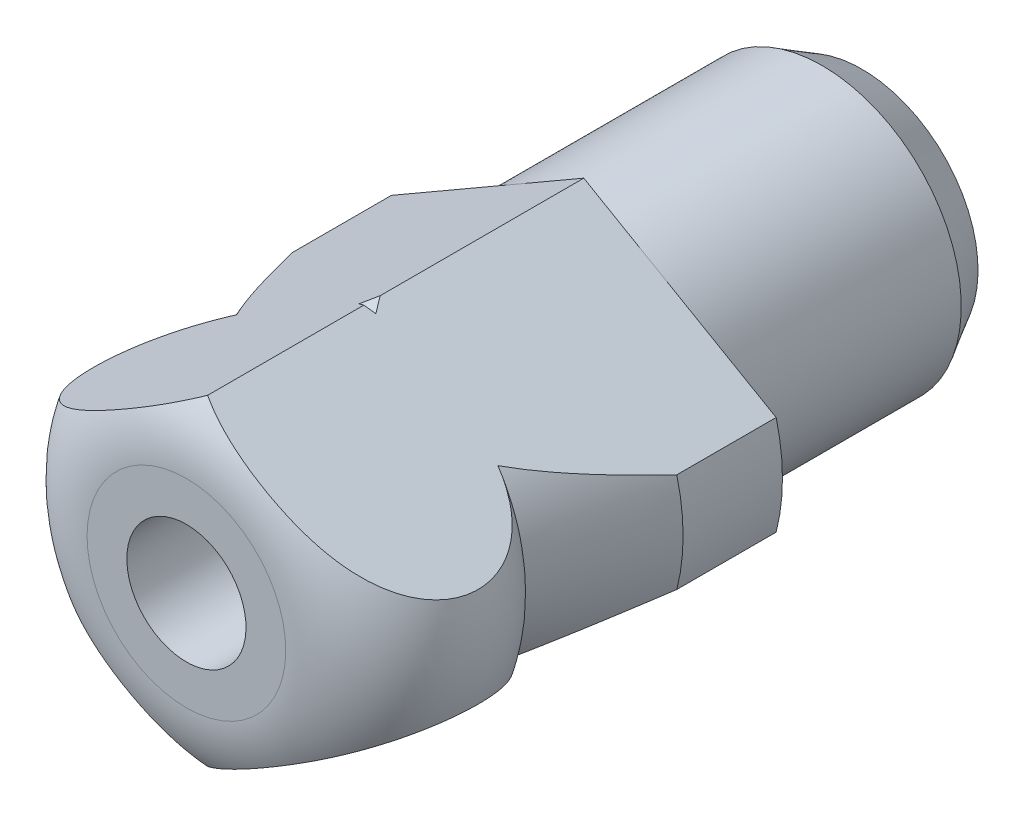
ISO-10303-21;
HEADER;
FILE_DESCRIPTION(('STEP AP214'),'2;1');
FILE_NAME('part.step','',(''),(''),'','','');
FILE_SCHEMA(('AUTOMOTIVE_DESIGN { 1 0 10303 214 1 1 1 1 }'));
ENDSEC;
DATA;
#1=APPLICATION_CONTEXT('core data for automotive mechanical design processes');
#2=APPLICATION_PROTOCOL_DEFINITION('international standard','automotive_design',2000,#1);
#3=PRODUCT_CONTEXT('',#1,'mechanical');
#4=PRODUCT('Part','Part','',(#3));
#5=PRODUCT_RELATED_PRODUCT_CATEGORY('part','',(#4));
#6=PRODUCT_DEFINITION_FORMATION('','',#4);
#7=PRODUCT_DEFINITION_CONTEXT('part definition',#1,'design');
#8=PRODUCT_DEFINITION('design','',#6,#7);
#9=PRODUCT_DEFINITION_SHAPE('','',#8);
#10=(LENGTH_UNIT() NAMED_UNIT(*) SI_UNIT(.MILLI.,.METRE.));
#11=(NAMED_UNIT(*) PLANE_ANGLE_UNIT() SI_UNIT($,.RADIAN.));
#12=(NAMED_UNIT(*) SI_UNIT($,.STERADIAN.) SOLID_ANGLE_UNIT());
#13=UNCERTAINTY_MEASURE_WITH_UNIT(LENGTH_MEASURE(1.E-05),#10,'distance_accuracy_value','');
#14=(GEOMETRIC_REPRESENTATION_CONTEXT(3) GLOBAL_UNCERTAINTY_ASSIGNED_CONTEXT((#13)) GLOBAL_UNIT_ASSIGNED_CONTEXT((#10,
#11,#12)) REPRESENTATION_CONTEXT('',''));
#15=CARTESIAN_POINT('',(0.,0.,0.));
#16=DIRECTION('',(0.,0.,1.));
#17=DIRECTION('',(1.,0.,0.));
#18=AXIS2_PLACEMENT_3D('',#15,#16,#17);
#19=CARTESIAN_POINT('',(-3.5,0.,0.));
#20=DIRECTION('',(0.,0.,1.));
#21=DIRECTION('',(0.,1.,0.));
#22=AXIS2_PLACEMENT_3D('',#19,#20,#21);
#23=PLANE('',#22);
#24=CARTESIAN_POINT('',(0.,0.,0.));
#25=DIRECTION('',(0.,0.,-1.));
#26=DIRECTION('',(0.,-1.,0.));
#27=AXIS2_PLACEMENT_3D('',#24,#25,#26);
#28=CIRCLE('',#27,3.5);
#29=CARTESIAN_POINT('',(0.,-3.5,0.));
#30=VERTEX_POINT('',#29);
#31=EDGE_CURVE('E236',#30,#30,#28,.T.);
#32=ORIENTED_EDGE('',*,*,#31,.F.);
#33=EDGE_LOOP('',(#32));
#34=FACE_BOUND('',#33,.T.);
#35=DIRECTION('',(0.866025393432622,0.500000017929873,0.));
#36=VECTOR('',#35,1.);
#37=CARTESIAN_POINT('',(-0.873426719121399,-4.54935815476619,0.));
#38=LINE('',#37,#36);
#39=CARTESIAN_POINT('',(1.79672318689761E-08,-4.04508496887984,0.));
#40=VERTEX_POINT('',#39);
#41=CARTESIAN_POINT('',(4.84122901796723,-1.24999996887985,0.));
#42=VERTEX_POINT('',#41);
#43=EDGE_CURVE('E255',#40,#42,#38,.T.);
#44=ORIENTED_EDGE('',*,*,#43,.F.);
#45=DIRECTION('',(0.866025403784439,-0.5,0.));
#46=VECTOR('',#45,1.);
#47=CARTESIAN_POINT('',(-4.37657316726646,-1.51826926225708,0.));
#48=LINE('',#47,#46);
#49=CARTESIAN_POINT('',(-4.84122918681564,-1.24999998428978,0.));
#50=VERTEX_POINT('',#49);
#51=EDGE_CURVE('E152',#50,#40,#48,.T.);
#52=ORIENTED_EDGE('',*,*,#51,.F.);
#53=CARTESIAN_POINT('',(0.,0.,0.));
#54=DIRECTION('',(0.,0.,-1.));
#55=DIRECTION('',(0.,-1.,0.));
#56=AXIS2_PLACEMENT_3D('',#53,#54,#55);
#57=CIRCLE('',#56,5.);
#58=CARTESIAN_POINT('',(-4.84122918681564,1.24999998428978,0.));
#59=VERTEX_POINT('',#58);
#60=EDGE_CURVE('E135',#50,#59,#57,.T.);
#61=ORIENTED_EDGE('',*,*,#60,.T.);
#62=DIRECTION('',(-0.86602540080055,-0.500000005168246,0.));
#63=VECTOR('',#62,1.);
#64=CARTESIAN_POINT('',(-4.37657317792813,1.51826925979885,0.));
#65=LINE('',#64,#63);
#66=CARTESIAN_POINT('',(9.3112878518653E-09,4.04508500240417,0.));
#67=VERTEX_POINT('',#66);
#68=EDGE_CURVE('E124',#67,#59,#65,.T.);
#69=ORIENTED_EDGE('',*,*,#68,.F.);
#70=DIRECTION('',(-0.866025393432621,0.500000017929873,0.));
#71=VECTOR('',#70,1.);
#72=CARTESIAN_POINT('',(-0.873426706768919,4.5493581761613,0.));
#73=LINE('',#72,#71);
#74=CARTESIAN_POINT('',(4.84122900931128,1.25000000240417,0.));
#75=VERTEX_POINT('',#74);
#76=EDGE_CURVE('E109',#75,#67,#73,.T.);
#77=ORIENTED_EDGE('',*,*,#76,.F.);
#78=EDGE_CURVE('E242',#75,#42,#57,.T.);
#79=ORIENTED_EDGE('',*,*,#78,.T.);
#80=EDGE_LOOP('',(#44,#52,#61,#69,#77,#79));
#81=FACE_BOUND('',#80,.T.);
#82=ADVANCED_FACE('F14',(#34,#81),#23,.F.);
#83=CARTESIAN_POINT('',(0.,0.,-7.));
#84=DIRECTION('',(0.,0.,-1.));
#85=DIRECTION('',(0.,-1.,0.));
#86=AXIS2_PLACEMENT_3D('',#83,#84,#85);
#87=CYLINDRICAL_SURFACE('',#86,5.);
#88=DIRECTION('',(0.,0.,1.));
#89=VECTOR('',#88,1.);
#90=CARTESIAN_POINT('',(4.84122901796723,-1.24999996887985,-7.));
#91=LINE('',#90,#89);
#92=CARTESIAN_POINT('',(4.84122901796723,-1.24999996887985,2.5000004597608));
#93=VERTEX_POINT('',#92);
#94=EDGE_CURVE('E290',#42,#93,#91,.T.);
#95=ORIENTED_EDGE('',*,*,#94,.F.);
#96=ORIENTED_EDGE('',*,*,#78,.F.);
#97=DIRECTION('',(0.,0.,1.));
#98=VECTOR('',#97,1.);
#99=CARTESIAN_POINT('',(4.84122900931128,1.25000000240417,-7.));
#100=LINE('',#99,#98);
#101=CARTESIAN_POINT('',(4.84122900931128,1.25000000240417,2.5000004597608));
#102=VERTEX_POINT('',#101);
#103=EDGE_CURVE('E114',#75,#102,#100,.T.);
#104=ORIENTED_EDGE('',*,*,#103,.T.);
#105=CARTESIAN_POINT('',(0.,0.,2.5));
#106=DIRECTION('',(0.,0.,-1.));
#107=DIRECTION('',(0.,-1.,0.));
#108=AXIS2_PLACEMENT_3D('',#105,#106,#107);
#109=CIRCLE('',#108,5.);
#110=EDGE_CURVE('E246',#102,#93,#109,.T.);
#111=ORIENTED_EDGE('',*,*,#110,.T.);
#112=EDGE_LOOP('',(#95,#96,#104,#111));
#113=FACE_BOUND('',#112,.T.);
#114=ADVANCED_FACE('F303',(#113),#87,.T.);
#115=DIRECTION('',(0.,0.,1.));
#116=VECTOR('',#115,1.);
#117=CARTESIAN_POINT('',(-4.84122918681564,-1.24999998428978,-7.));
#118=LINE('',#117,#116);
#119=CARTESIAN_POINT('',(-4.84122918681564,-1.24999998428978,2.5));
#120=VERTEX_POINT('',#119);
#121=EDGE_CURVE('E269',#50,#120,#118,.T.);
#122=ORIENTED_EDGE('',*,*,#121,.T.);
#123=CARTESIAN_POINT('',(-4.84122918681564,1.24999998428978,2.5));
#124=VERTEX_POINT('',#123);
#125=EDGE_CURVE('E243',#120,#124,#109,.T.);
#126=ORIENTED_EDGE('',*,*,#125,.T.);
#127=DIRECTION('',(0.,0.,1.));
#128=VECTOR('',#127,1.);
#129=CARTESIAN_POINT('',(-4.84122918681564,1.24999998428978,-7.));
#130=LINE('',#129,#128);
#131=EDGE_CURVE('E128',#59,#124,#130,.T.);
#132=ORIENTED_EDGE('',*,*,#131,.F.);
#133=ORIENTED_EDGE('',*,*,#60,.F.);
#134=EDGE_LOOP('',(#122,#126,#132,#133));
#135=FACE_BOUND('',#134,.T.);
#136=ADVANCED_FACE('F276',(#135),#87,.T.);
#137=CARTESIAN_POINT('',(0.,0.,5.44743185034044));
#138=DIRECTION('',(0.,0.,-1.));
#139=DIRECTION('',(0.,-1.,0.));
#140=AXIS2_PLACEMENT_3D('',#137,#138,#139);
#141=CONICAL_SURFACE('',#140,3.9272224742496,0.34906586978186);
#142=CARTESIAN_POINT('',(6.36956118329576,-0.367616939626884,-1.29196041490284));
#143=CARTESIAN_POINT('',(6.30104796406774,-0.407173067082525,-1.11030512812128));
#144=CARTESIAN_POINT('',(6.2321540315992,-0.446948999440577,-0.92884098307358));
#145=CARTESIAN_POINT('',(6.09348453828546,-0.527009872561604,-0.566358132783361));
#146=CARTESIAN_POINT('',(6.02370895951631,-0.567294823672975,-0.385339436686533));
#147=CARTESIAN_POINT('',(5.81281108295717,-0.689056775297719,0.157129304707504));
#148=CARTESIAN_POINT('',(5.6701881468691,-0.771400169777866,0.517804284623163));
#149=CARTESIAN_POINT('',(5.37957493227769,-0.939185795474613,1.23636755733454));
#150=CARTESIAN_POINT('',(5.23158359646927,-1.02462863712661,1.59425528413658));
#151=CARTESIAN_POINT('',(5.00398625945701,-1.15603202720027,2.12785476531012));
#152=CARTESIAN_POINT('',(4.92719306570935,-1.20036860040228,2.30516570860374));
#153=CARTESIAN_POINT('',(4.77132994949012,-1.29035621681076,2.65844623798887));
#154=CARTESIAN_POINT('',(4.69226009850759,-1.33600721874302,2.83441586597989));
#155=CARTESIAN_POINT('',(4.55274608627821,-1.41655567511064,3.13803479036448));
#156=CARTESIAN_POINT('',(4.49294621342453,-1.45108114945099,3.26607855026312));
#157=CARTESIAN_POINT('',(4.37157182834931,-1.52115668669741,3.52104849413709));
#158=CARTESIAN_POINT('',(4.30999725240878,-1.55670678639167,3.64797463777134));
#159=CARTESIAN_POINT('',(4.18466507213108,-1.6290673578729,3.90058478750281));
#160=CARTESIAN_POINT('',(4.12090497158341,-1.66587927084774,4.02626714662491));
#161=CARTESIAN_POINT('',(3.99083642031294,-1.74097438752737,4.27585758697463));
#162=CARTESIAN_POINT('',(3.92452813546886,-1.77925749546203,4.39976578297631));
#163=CARTESIAN_POINT('',(3.79460264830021,-1.85427001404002,4.63474685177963));
#164=CARTESIAN_POINT('',(3.7312427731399,-1.89085085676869,4.74600874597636));
#165=CARTESIAN_POINT('',(3.60131769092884,-1.96586314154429,4.96600414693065));
#166=CARTESIAN_POINT('',(3.53475287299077,-2.0042943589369,5.07473795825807));
#167=CARTESIAN_POINT('',(3.39771532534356,-2.083413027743,5.28865120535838));
#168=CARTESIAN_POINT('',(3.32724840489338,-2.12409712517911,5.39383556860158));
#169=CARTESIAN_POINT('',(3.18127217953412,-2.20837654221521,5.59939494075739));
#170=CARTESIAN_POINT('',(3.10576578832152,-2.25197017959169,5.69977267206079));
#171=CARTESIAN_POINT('',(2.95421093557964,-2.33947041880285,5.88611178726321));
#172=CARTESIAN_POINT('',(2.87864344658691,-2.38309933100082,5.9725887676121));
#173=CARTESIAN_POINT('',(2.72030575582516,-2.47451564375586,6.13660144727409));
#174=CARTESIAN_POINT('',(2.63753298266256,-2.52230452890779,6.21413393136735));
#175=CARTESIAN_POINT('',(2.47947527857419,-2.61355919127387,6.3418009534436));
#176=CARTESIAN_POINT('',(2.40568043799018,-2.65616466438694,6.39434795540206));
#177=CARTESIAN_POINT('',(2.25188488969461,-2.74495856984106,6.48548949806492));
#178=CARTESIAN_POINT('',(2.17190279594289,-2.79113625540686,6.52412405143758));
#179=CARTESIAN_POINT('',(2.02759642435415,-2.87445158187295,6.57477643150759));
#180=CARTESIAN_POINT('',(1.96441154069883,-2.91093139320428,6.59104995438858));
#181=CARTESIAN_POINT('',(1.83655464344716,-2.98474961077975,6.61091902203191));
#182=CARTESIAN_POINT('',(1.77188382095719,-3.02208732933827,6.61452438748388));
#183=CARTESIAN_POINT('',(1.64299338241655,-3.09650226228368,6.60858173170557));
#184=CARTESIAN_POINT('',(1.57877391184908,-3.13357939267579,6.59902964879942));
#185=CARTESIAN_POINT('',(1.45256571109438,-3.20644573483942,6.56800634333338));
#186=CARTESIAN_POINT('',(1.39057863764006,-3.24223399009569,6.54652645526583));
#187=CARTESIAN_POINT('',(1.24095545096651,-3.328618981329,6.48123405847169));
#188=CARTESIAN_POINT('',(1.15523528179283,-3.37810954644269,6.43165366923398));
#189=CARTESIAN_POINT('',(0.991204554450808,-3.47281273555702,6.31815711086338));
#190=CARTESIAN_POINT('',(0.912921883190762,-3.51800925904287,6.25418979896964));
#191=CARTESIAN_POINT('',(0.739365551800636,-3.61821205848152,6.09542487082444));
#192=CARTESIAN_POINT('',(0.646452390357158,-3.67185549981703,5.99724689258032));
#193=CARTESIAN_POINT('',(0.469031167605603,-3.77428969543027,5.79112333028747));
#194=CARTESIAN_POINT('',(0.384541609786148,-3.82306976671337,5.6831571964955));
#195=CARTESIAN_POINT('',(0.220990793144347,-3.91749587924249,5.45961288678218));
#196=CARTESIAN_POINT('',(0.142010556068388,-3.9630951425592,5.343956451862));
#197=CARTESIAN_POINT('',(0.0273868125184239,-4.02927319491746,5.16729546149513));
#198=CARTESIAN_POINT('',(-0.0101618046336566,-4.05095190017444,5.10791021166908));
#199=CARTESIAN_POINT('',(-0.0841398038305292,-4.09366311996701,4.98821793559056));
#200=CARTESIAN_POINT('',(-0.120569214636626,-4.11469565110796,4.92791093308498));
#201=CARTESIAN_POINT('',(-0.230716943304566,-4.17828947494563,4.74187503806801));
#202=CARTESIAN_POINT('',(-0.302827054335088,-4.21992226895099,4.61487627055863));
#203=CARTESIAN_POINT('',(-0.443724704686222,-4.30126956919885,4.35843613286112));
#204=CARTESIAN_POINT('',(-0.512511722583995,-4.34098377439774,4.22899438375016));
#205=CARTESIAN_POINT('',(-0.647421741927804,-4.41887411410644,3.96818921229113));
#206=CARTESIAN_POINT('',(-0.7135433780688,-4.45704946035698,3.83682485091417));
#207=CARTESIAN_POINT('',(-0.843561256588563,-4.53211532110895,3.57263299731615));
#208=CARTESIAN_POINT('',(-0.907457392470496,-4.5690057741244,3.43980543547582));
#209=CARTESIAN_POINT('',(-1.09674623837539,-4.67829174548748,3.03879119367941));
#210=CARTESIAN_POINT('',(-1.2193456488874,-4.74907455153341,2.7688470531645));
#211=CARTESIAN_POINT('',(-1.45913826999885,-4.88751889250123,2.2259044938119));
#212=CARTESIAN_POINT('',(-1.57633305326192,-4.95518133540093,1.95290699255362));
#213=CARTESIAN_POINT('',(-1.79468428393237,-5.08124648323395,1.4331578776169));
#214=CARTESIAN_POINT('',(-1.89624102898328,-5.13988030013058,1.18662983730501));
#215=CARTESIAN_POINT('',(-2.09676437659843,-5.2556525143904,0.692149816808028));
#216=CARTESIAN_POINT('',(-2.19573074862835,-5.31279077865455,0.444197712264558));
#217=CARTESIAN_POINT('',(-2.39096419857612,-5.4255088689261,-0.0513077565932));
#218=CARTESIAN_POINT('',(-2.48724398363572,-5.48109603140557,-0.29885445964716));
#219=CARTESIAN_POINT('',(-2.67805280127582,-5.59125955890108,-0.794805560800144));
#220=CARTESIAN_POINT('',(-2.77258207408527,-5.64583606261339,-1.04320983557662));
#221=CARTESIAN_POINT('',(-2.86641474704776,-5.7000103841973,-1.29196041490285));
#222=B_SPLINE_CURVE_WITH_KNOTS('',3,(#142,#143,#144,#145,#146,#147,#148,#149,#150,#151,#152,
#153,#154,#155,#156,#157,#158,#159,#160,#161,#162,#163,#164,#165,#166,#167,#168,#169,#170,#171,
#172,#173,#174,#175,#176,#177,#178,#179,#180,#181,#182,#183,#184,#185,#186,#187,#188,#189,#190,
#191,#192,#193,#194,#195,#196,#197,#198,#199,#200,#201,#202,#203,#204,#205,#206,#207,#208,#209,
#210,#211,#212,#213,#214,#215,#216,#217,#218,#219,#220,#221),.UNSPECIFIED.,.F.,.F.,(4,2,2,2,2,2,
2,2,2,2,2,2,2,2,2,2,2,2,2,2,2,2,2,2,2,2,2,2,2,2,2,2,2,2,2,2,2,2,2,4),(0.,0.59440387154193,
1.18881984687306,2.378265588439,3.56794687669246,4.16267335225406,4.75738117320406,
5.19379387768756,5.63022227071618,6.06716692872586,6.50408319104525,6.90350779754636,
7.30288403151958,7.70168089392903,8.10024914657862,8.46840539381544,8.83669357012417,
9.13617724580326,9.4347925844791,9.65808447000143,9.88120321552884,10.1043908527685,
10.3277408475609,10.6579393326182,10.9893307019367,11.4245448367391,11.8606948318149,
12.3022947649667,12.522869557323,12.7434386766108,13.1989234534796,13.6544794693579,
14.1102659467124,14.5660742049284,15.4803824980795,16.3944230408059,17.2133912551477,
18.032432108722,18.8465184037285,19.6604921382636),.UNSPECIFIED.);
#223=CARTESIAN_POINT('',(3.28887008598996,-2.14625485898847,5.44743185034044));
#224=VERTEX_POINT('',#223);
#225=EDGE_CURVE('E257',#93,#224,#222,.T.);
#226=ORIENTED_EDGE('',*,*,#225,.F.);
#227=ORIENTED_EDGE('',*,*,#110,.F.);
#228=CARTESIAN_POINT('',(-2.86641472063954,5.70001039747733,-1.29196041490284));
#229=CARTESIAN_POINT('',(-2.79790150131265,5.6604542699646,-1.11030512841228));
#230=CARTESIAN_POINT('',(-2.72900756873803,5.62067833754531,-0.928840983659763));
#231=CARTESIAN_POINT('',(-2.5903380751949,5.54061746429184,-0.566358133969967));
#232=CARTESIAN_POINT('',(-2.52056249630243,5.50033251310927,-0.385339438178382));
#233=CARTESIAN_POINT('',(-2.30966461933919,5.37857056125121,0.157129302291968));
#234=CARTESIAN_POINT('',(-2.16704168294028,5.2962271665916,0.517804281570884));
#235=CARTESIAN_POINT('',(-1.876428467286,5.12844154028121,1.23636755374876));
#236=CARTESIAN_POINT('',(-1.72843713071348,5.04299869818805,1.59425528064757));
#237=CARTESIAN_POINT('',(-1.50083979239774,4.91159530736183,2.12785476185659));
#238=CARTESIAN_POINT('',(-1.42404659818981,4.86725873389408,2.30516570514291));
#239=CARTESIAN_POINT('',(-1.26818348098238,4.77727111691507,2.65844623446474));
#240=CARTESIAN_POINT('',(-1.18911362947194,4.73162011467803,2.83441586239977));
#241=CARTESIAN_POINT('',(-1.04959961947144,4.65107165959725,3.13803477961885));
#242=CARTESIAN_POINT('',(-0.989799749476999,4.61654618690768,3.26607853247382));
#243=CARTESIAN_POINT('',(-0.868425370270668,4.54647065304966,3.52104846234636));
#244=CARTESIAN_POINT('',(-0.806850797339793,4.51092055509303,3.64797459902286));
#245=CARTESIAN_POINT('',(-0.681518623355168,4.43855998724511,3.9005847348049));
#246=CARTESIAN_POINT('',(-0.617758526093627,4.40174807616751,4.02626708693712));
#247=CARTESIAN_POINT('',(-0.487689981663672,4.32665296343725,4.27585751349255));
#248=CARTESIAN_POINT('',(-0.421381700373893,4.28836985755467,4.39976570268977));
#249=CARTESIAN_POINT('',(-0.291456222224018,4.21335734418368,4.6347467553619));
#250=CARTESIAN_POINT('',(-0.228096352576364,4.17677650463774,4.74600864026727));
#251=CARTESIAN_POINT('',(-0.0981712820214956,4.10176422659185,4.96600402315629));
#252=CARTESIAN_POINT('',(-0.0316064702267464,4.06333301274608,5.07473782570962));
#253=CARTESIAN_POINT('',(0.105431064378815,3.98421435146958,5.28865105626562));
#254=CARTESIAN_POINT('',(0.175897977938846,3.9435302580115,5.39383541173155));
#255=CARTESIAN_POINT('',(0.321874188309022,3.85925084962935,5.59939476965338));
#256=CARTESIAN_POINT('',(0.397380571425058,3.81565721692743,5.69977249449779));
#257=CARTESIAN_POINT('',(0.548935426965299,3.72815697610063,5.88611162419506));
#258=CARTESIAN_POINT('',(0.624502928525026,3.6845280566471,5.97258862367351));
#259=CARTESIAN_POINT('',(0.782840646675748,3.59311172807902,6.13660133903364));
#260=CARTESIAN_POINT('',(0.865613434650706,3.54532283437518,6.21413383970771));
#261=CARTESIAN_POINT('',(1.02367115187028,3.4540681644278,6.34180087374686));
#262=CARTESIAN_POINT('',(1.09746598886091,3.41146269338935,6.39434787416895));
#263=CARTESIAN_POINT('',(1.25126152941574,3.32266879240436,6.48548941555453));
#264=CARTESIAN_POINT('',(1.33124361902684,3.27649110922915,6.52412396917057));
#265=CARTESIAN_POINT('',(1.47554998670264,3.1931757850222,6.57477635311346));
#266=CARTESIAN_POINT('',(1.53873487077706,3.15669597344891,6.59104987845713));
#267=CARTESIAN_POINT('',(1.66659176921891,3.08287775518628,6.61091895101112));
#268=CARTESIAN_POINT('',(1.73126259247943,3.04554003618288,6.61452431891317));
#269=CARTESIAN_POINT('',(1.86015303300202,2.9711251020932,6.60858166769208));
#270=CARTESIAN_POINT('',(1.92437250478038,2.93404797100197,6.59902958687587));
#271=CARTESIAN_POINT('',(2.05058070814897,2.86118162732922,6.56800628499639));
#272=CARTESIAN_POINT('',(2.11256778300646,2.82539337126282,6.54652639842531));
#273=CARTESIAN_POINT('',(2.26219096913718,2.73900838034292,6.48123400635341));
#274=CARTESIAN_POINT('',(2.34791113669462,2.68951781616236,6.43165362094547));
#275=CARTESIAN_POINT('',(2.51194186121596,2.59481462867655,6.31815707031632));
#276=CARTESIAN_POINT('',(2.59022453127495,2.54961810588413,6.25418976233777));
#277=CARTESIAN_POINT('',(2.76378085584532,2.44941531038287,6.09542484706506));
#278=CARTESIAN_POINT('',(2.85669401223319,2.39577187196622,5.99724687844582));
#279=CARTESIAN_POINT('',(3.03411522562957,2.29333768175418,5.79112333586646));
#280=CARTESIAN_POINT('',(3.11860477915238,2.24455761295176,5.68315721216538));
#281=CARTESIAN_POINT('',(3.28215558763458,2.15013150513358,5.45961292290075));
#282=CARTESIAN_POINT('',(3.3611358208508,2.1045322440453,5.34395649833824));
#283=CARTESIAN_POINT('',(3.47575955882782,2.03835419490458,5.16729552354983));
#284=CARTESIAN_POINT('',(3.51330817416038,2.0166754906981,5.10791027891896));
#285=CARTESIAN_POINT('',(3.58728616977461,1.97396427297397,4.98821801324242));
#286=CARTESIAN_POINT('',(3.62371557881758,1.95293174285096,4.92791101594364));
#287=CARTESIAN_POINT('',(3.73386330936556,1.88933791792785,4.74187512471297));
#288=CARTESIAN_POINT('',(3.80597342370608,1.84770512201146,4.61487635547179));
#289=CARTESIAN_POINT('',(3.94687108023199,1.76635781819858,4.35843621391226));
#290=CARTESIAN_POINT('',(4.01565810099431,1.72664361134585,4.22899446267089));
#291=CARTESIAN_POINT('',(4.15056812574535,1.64875326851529,3.9681892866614));
#292=CARTESIAN_POINT('',(4.21668976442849,1.61057792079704,3.83682492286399));
#293=CARTESIAN_POINT('',(4.34670764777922,1.53551205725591,3.57263306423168));
#294=CARTESIAN_POINT('',(4.41060378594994,1.49862160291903,3.43980549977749));
#295=CARTESIAN_POINT('',(4.59989263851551,1.3893356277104,3.03879124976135));
#296=CARTESIAN_POINT('',(4.72249205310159,1.3185528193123,2.76884710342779));
#297=CARTESIAN_POINT('',(4.96228468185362,1.18010847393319,2.22590453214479));
#298=CARTESIAN_POINT('',(5.07947946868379,1.11244602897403,1.9529070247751));
#299=CARTESIAN_POINT('',(5.29783070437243,0.986380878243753,1.43315790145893));
#300=CARTESIAN_POINT('',(5.39938745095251,0.927747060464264,1.18662985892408));
#301=CARTESIAN_POINT('',(5.59991080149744,0.811974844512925,0.692149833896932));
#302=CARTESIAN_POINT('',(5.69887717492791,0.75483657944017,0.444197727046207));
#303=CARTESIAN_POINT('',(5.89411062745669,0.64211848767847,-0.0513077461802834));
#304=CARTESIAN_POINT('',(5.99039041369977,0.586531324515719,-0.298854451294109));
#305=CARTESIAN_POINT('',(6.18119923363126,0.476367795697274,-0.794805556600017));
#306=CARTESIAN_POINT('',(6.27572850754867,0.421791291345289,-1.04320983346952));
#307=CARTESIAN_POINT('',(6.36956118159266,0.367616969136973,-1.29196041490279));
#308=B_SPLINE_CURVE_WITH_KNOTS('',3,(#228,#229,#230,#231,#232,#233,#234,#235,#236,#237,#238,
#239,#240,#241,#242,#243,#244,#245,#246,#247,#248,#249,#250,#251,#252,#253,#254,#255,#256,#257,
#258,#259,#260,#261,#262,#263,#264,#265,#266,#267,#268,#269,#270,#271,#272,#273,#274,#275,#276,
#277,#278,#279,#280,#281,#282,#283,#284,#285,#286,#287,#288,#289,#290,#291,#292,#293,#294,#295,
#296,#297,#298,#299,#300,#301,#302,#303,#304,#305,#306,#307),.UNSPECIFIED.,.F.,.F.,(4,2,2,2,2,2,
2,2,2,2,2,2,2,2,2,2,2,2,2,2,2,2,2,2,2,2,2,2,2,2,2,2,2,2,2,2,2,2,2,4),(0.,0.594403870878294,
1.18881984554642,2.37826558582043,3.56794687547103,4.16267335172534,4.75738117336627,
5.19379385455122,5.63022222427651,6.06716685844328,6.50408309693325,6.90350766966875,
7.30288386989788,7.70168069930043,8.10024891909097,8.46840523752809,8.83669348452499,
9.13617714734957,9.43479247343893,9.65808436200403,9.8812031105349,10.104390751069,
10.3277407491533,10.6579392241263,10.9893305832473,11.4245446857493,11.860694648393,
12.3022945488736,12.5228693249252,12.7434384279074,13.1989232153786,13.6544792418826,
14.1102657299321,14.5660739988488,15.4803823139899,16.3944228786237,17.2133911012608,
18.0324319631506,18.8465182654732,19.6604920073),.UNSPECIFIED.);
#309=CARTESIAN_POINT('',(3.28887005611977,2.14625490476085,5.44743185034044));
#310=VERTEX_POINT('',#309);
#311=EDGE_CURVE('E120',#310,#102,#308,.T.);
#312=ORIENTED_EDGE('',*,*,#311,.F.);
#313=CARTESIAN_POINT('',(0.,0.,5.44743185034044));
#314=DIRECTION('',(0.,0.,-1.));
#315=DIRECTION('',(0.,-1.,0.));
#316=AXIS2_PLACEMENT_3D('',#313,#314,#315);
#317=CIRCLE('',#316,3.9272224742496);
#318=EDGE_CURVE('E250',#310,#224,#317,.T.);
#319=ORIENTED_EDGE('',*,*,#318,.T.);
#320=EDGE_LOOP('',(#226,#227,#312,#319));
#321=FACE_BOUND('',#320,.T.);
#322=ADVANCED_FACE('F154',(#321),#141,.T.);
#323=CARTESIAN_POINT('',(2.8664148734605,-5.70001035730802,-1.2919605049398));
#324=CARTESIAN_POINT('',(2.79790165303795,-5.66045423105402,-1.11030521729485));
#325=CARTESIAN_POINT('',(2.72900771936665,-5.62067829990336,-0.928841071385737));
#326=CARTESIAN_POINT('',(2.5903382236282,-5.54061742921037,-0.566358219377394));
#327=CARTESIAN_POINT('',(2.52056264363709,-5.50033247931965,-0.385339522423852));
#328=CARTESIAN_POINT('',(2.30966476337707,-5.37857053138,0.157129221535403));
#329=CARTESIAN_POINT('',(2.16704182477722,-5.29622713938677,0.517804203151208));
#330=CARTESIAN_POINT('',(1.87642860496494,-5.12844151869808,1.23636747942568));
#331=CARTESIAN_POINT('',(1.72843726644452,-5.04299867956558,1.59425520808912));
#332=CARTESIAN_POINT('',(1.50083992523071,-4.91159529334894,2.12785469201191));
#333=CARTESIAN_POINT('',(1.42404673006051,-4.8672587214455,2.30516563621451));
#334=CARTESIAN_POINT('',(1.26818361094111,-4.77727110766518,2.65844616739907));
#335=CARTESIAN_POINT('',(1.18911375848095,-4.73162010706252,2.83441579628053));
#336=CARTESIAN_POINT('',(1.04959974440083,-4.65107165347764,3.13803472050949));
#337=CARTESIAN_POINT('',(0.989799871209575,-4.61654618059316,3.26607847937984));
#338=CARTESIAN_POINT('',(0.868425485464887,-4.54647064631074,3.52104842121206));
#339=CARTESIAN_POINT('',(0.806850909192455,-4.51092054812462,3.64797456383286));
#340=CARTESIAN_POINT('',(0.68151872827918,-4.43855997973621,3.9005847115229));
#341=CARTESIAN_POINT('',(0.617758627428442,-4.40174806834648,4.02626706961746));
#342=CARTESIAN_POINT('',(0.487690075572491,-4.32665295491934,4.27585750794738));
#343=CARTESIAN_POINT('',(0.421381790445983,-4.28836984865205,4.39976570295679));
#344=CARTESIAN_POINT('',(0.291456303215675,-4.21335733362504,4.63474676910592));
#345=CARTESIAN_POINT('',(0.228096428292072,-4.17677649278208,4.74600866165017));
#346=CARTESIAN_POINT('',(0.0981713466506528,-4.10176421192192,4.96600405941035));
#347=CARTESIAN_POINT('',(0.0316065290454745,-4.06333299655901,5.07473786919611));
#348=CARTESIAN_POINT('',(-0.105431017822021,-3.98421433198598,5.28865111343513));
#349=CARTESIAN_POINT('',(-0.17589793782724,-3.943530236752,5.39383547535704));
#350=CARTESIAN_POINT('',(-0.321874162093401,-3.85925082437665,5.59939484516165));
#351=CARTESIAN_POINT('',(-0.397380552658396,-3.81565718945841,5.69977257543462));
#352=CARTESIAN_POINT('',(-0.548935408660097,-3.72815695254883,5.88611169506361));
#353=CARTESIAN_POINT('',(-0.624502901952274,-3.68452803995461,5.97258868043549));
#354=CARTESIAN_POINT('',(-0.782840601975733,-3.5931117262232,6.13660136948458));
#355=CARTESIAN_POINT('',(-0.865613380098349,-3.54532284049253,6.21413385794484));
#356=CARTESIAN_POINT('',(-1.02367109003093,-3.45406817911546,6.34180088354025));
#357=CARTESIAN_POINT('',(-1.09746593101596,-3.41146270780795,6.39434788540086));
#358=CARTESIAN_POINT('',(-1.25126148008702,-3.32266880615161,6.48548942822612));
#359=CARTESIAN_POINT('',(-1.33124357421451,-3.27649112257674,6.52412398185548));
#360=CARTESIAN_POINT('',(-1.47554994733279,-3.19317579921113,6.57477636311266));
#361=CARTESIAN_POINT('',(-1.53873483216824,-3.15669598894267,6.59104988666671));
#362=CARTESIAN_POINT('',(-1.66659173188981,-3.08287777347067,6.6109189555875));
#363=CARTESIAN_POINT('',(-1.73126255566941,-3.0455400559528,6.61452432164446));
#364=CARTESIAN_POINT('',(-1.86015299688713,-2.97112512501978,6.60858166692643));
#365=CARTESIAN_POINT('',(-1.92437246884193,-2.93404799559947,6.59902958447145));
#366=CARTESIAN_POINT('',(-2.05058067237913,-2.86118165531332,6.56800627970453));
#367=CARTESIAN_POINT('',(-2.11256774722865,-2.82539340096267,6.54652639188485));
#368=CARTESIAN_POINT('',(-2.26219093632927,-2.73900841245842,6.48123399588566));
#369=CARTESIAN_POINT('',(-2.34791110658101,-2.6895178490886,6.43165360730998));
#370=CARTESIAN_POINT('',(-2.5119418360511,-2.59481466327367,6.3181570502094));
#371=CARTESIAN_POINT('',(-2.59022450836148,-2.54961814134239,6.25418973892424));
#372=CARTESIAN_POINT('',(-2.76378084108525,-2.44941534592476,6.09542481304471));
#373=CARTESIAN_POINT('',(-2.85669400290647,-2.39577190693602,5.99724683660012));
#374=CARTESIAN_POINT('',(-3.03411522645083,-2.29333771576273,5.79112327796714));
#375=CARTESIAN_POINT('',(-3.11860478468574,-2.24455764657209,5.68315714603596));
#376=CARTESIAN_POINT('',(-3.28215560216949,-2.15013153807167,5.45961284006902));
#377=CARTESIAN_POINT('',(-3.36113583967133,-2.10453227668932,5.34395640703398));
#378=CARTESIAN_POINT('',(-3.47575958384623,-2.03835422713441,5.16729541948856));
#379=CARTESIAN_POINT('',(-3.51330820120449,-2.01667552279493,5.107910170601));
#380=CARTESIAN_POINT('',(-3.58728620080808,-1.97396430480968,4.9882178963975));
#381=CARTESIAN_POINT('',(-3.62371561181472,-1.95293177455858,4.92791089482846));
#382=CARTESIAN_POINT('',(-3.73386334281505,-1.88933795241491,4.74187499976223));
#383=CARTESIAN_POINT('',(-3.80597345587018,-1.84770515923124,4.61487623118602));
#384=CARTESIAN_POINT('',(-3.94687111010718,-1.76635786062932,4.35843609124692));
#385=CARTESIAN_POINT('',(-4.01565812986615,-1.72664365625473,4.22899434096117));
#386=CARTESIAN_POINT('',(-4.15056815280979,-1.64875331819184,3.96818916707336));
#387=CARTESIAN_POINT('',(-4.21668979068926,-1.61057797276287,3.83682480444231));
#388=CARTESIAN_POINT('',(-4.34670767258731,-1.53551211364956,3.5726329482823));
#389=CARTESIAN_POINT('',(-4.41060381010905,-1.49862166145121,3.43980538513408));
#390=CARTESIAN_POINT('',(-4.59989266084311,-1.3893356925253,3.03879113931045));
#391=CARTESIAN_POINT('',(-4.72249207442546,-1.31855288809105,2.76884699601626));
#392=CARTESIAN_POINT('',(-4.96228470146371,-1.18010855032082,2.22590443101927));
#393=CARTESIAN_POINT('',(-5.07947948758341,-1.112446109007,1.95290692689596));
#394=CARTESIAN_POINT('',(-5.29783072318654,-0.986380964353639,1.43315780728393));
#395=CARTESIAN_POINT('',(-5.39938747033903,-0.927747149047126,1.18662976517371));
#396=CARTESIAN_POINT('',(-5.59991082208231,-0.81197493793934,0.692149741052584));
#397=CARTESIAN_POINT('',(-5.69887719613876,-0.754836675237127,0.44419763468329));
#398=CARTESIAN_POINT('',(-5.89411065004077,-0.642118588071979,-0.0513078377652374));
#399=CARTESIAN_POINT('',(-5.99039043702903,-0.586531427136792,-0.298854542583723));
#400=CARTESIAN_POINT('',(-6.18119925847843,-0.476367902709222,-0.794805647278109));
#401=CARTESIAN_POINT('',(-6.27572853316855,-0.421791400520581,-1.04320992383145));
#402=CARTESIAN_POINT('',(-6.36956120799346,-0.367617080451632,-1.29196050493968));
#403=B_SPLINE_CURVE_WITH_KNOTS('',3,(#323,#324,#325,#326,#327,#328,#329,#330,#331,#332,#333,
#334,#335,#336,#337,#338,#339,#340,#341,#342,#343,#344,#345,#346,#347,#348,#349,#350,#351,#352,
#353,#354,#355,#356,#357,#358,#359,#360,#361,#362,#363,#364,#365,#366,#367,#368,#369,#370,#371,
#372,#373,#374,#375,#376,#377,#378,#379,#380,#381,#382,#383,#384,#385,#386,#387,#388,#389,#390,
#391,#392,#393,#394,#395,#396,#397,#398,#399,#400,#401,#402),.UNSPECIFIED.,.F.,.F.,(4,2,2,2,2,2,
2,2,2,2,2,2,2,2,2,2,2,2,2,2,2,2,2,2,2,2,2,2,2,2,2,2,2,2,2,2,2,2,2,4),(0.,0.594403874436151,
1.18881985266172,2.37826560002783,3.56794689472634,4.16267337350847,4.75738119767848,
5.19379389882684,5.63022228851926,6.06716694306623,6.504083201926,6.90350780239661,
7.30288403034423,7.70168088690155,8.10024913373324,8.46840539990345,8.83669359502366,
9.13617726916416,9.43479260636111,9.65808449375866,9.88120324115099,10.1043908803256,
10.3277408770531,10.6579393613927,10.9893307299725,11.4245448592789,11.860694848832,
12.3022947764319,12.5228695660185,12.7434386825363,13.1989234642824,13.6544794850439,
14.1102659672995,14.566074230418,15.4803825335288,16.3944230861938,17.2133913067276,
18.0324321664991,18.8465184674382,19.6604922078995),.UNSPECIFIED.);
#404=CARTESIAN_POINT('',(-3.28887001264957,-2.14625497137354,5.44743185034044));
#405=VERTEX_POINT('',#404);
#406=EDGE_CURVE('E137',#405,#120,#403,.T.);
#407=ORIENTED_EDGE('',*,*,#406,.F.);
#408=CARTESIAN_POINT('',(-3.2888699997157,2.1462549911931,5.44743185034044));
#409=VERTEX_POINT('',#408);
#410=EDGE_CURVE('E252',#405,#409,#317,.T.);
#411=ORIENTED_EDGE('',*,*,#410,.T.);
#412=CARTESIAN_POINT('',(-6.36956121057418,0.367617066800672,-1.29196050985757));
#413=CARTESIAN_POINT('',(-6.30104799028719,0.407173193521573,-1.11030522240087));
#414=CARTESIAN_POINT('',(-6.23215405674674,0.446949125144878,-0.928841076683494));
#415=CARTESIAN_POINT('',(-6.0934845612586,0.527009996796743,-0.56635822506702));
#416=CARTESIAN_POINT('',(-6.02370898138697,0.5672949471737,-0.385339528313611));
#417=CARTESIAN_POINT('',(-5.81281110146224,0.689056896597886,0.157129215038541));
#418=CARTESIAN_POINT('',(-5.67018816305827,0.771400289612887,0.517804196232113));
#419=CARTESIAN_POINT('',(-5.37957494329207,0.939185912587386,1.23636747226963));
#420=CARTESIAN_POINT('',(-5.23158360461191,1.02462875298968,1.59425520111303));
#421=CARTESIAN_POINT('',(-5.00398626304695,1.15603214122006,2.12785468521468));
#422=CARTESIAN_POINT('',(-4.92719306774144,1.20036871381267,2.30516562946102));
#423=CARTESIAN_POINT('',(-4.77132994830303,1.29035632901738,2.65844616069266));
#424=CARTESIAN_POINT('',(-4.69226009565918,1.33600733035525,2.83441578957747));
#425=CARTESIAN_POINT('',(-4.55274608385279,1.41655578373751,3.13803470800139));
#426=CARTESIAN_POINT('',(-4.49294621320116,1.45108125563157,3.26607846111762));
#427=CARTESIAN_POINT('',(-4.37157183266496,1.52115678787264,3.52104839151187));
#428=CARTESIAN_POINT('',(-4.30999725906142,1.55670688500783,3.64797452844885));
#429=CARTESIAN_POINT('',(-4.18466508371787,1.62906745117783,3.90058466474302));
#430=CARTESIAN_POINT('',(-4.12090498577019,1.66587936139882,4.026267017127));
#431=CARTESIAN_POINT('',(-3.99083643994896,1.74097447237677,4.27585744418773));
#432=CARTESIAN_POINT('',(-3.92452815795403,1.77925757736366,4.3997656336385));
#433=CARTESIAN_POINT('',(-3.79460267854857,1.85427008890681,4.63474668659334));
#434=CARTESIAN_POINT('',(-3.73124280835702,1.89085092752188,4.74600857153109));
#435=CARTESIAN_POINT('',(-3.60131773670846,1.96586320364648,4.96600395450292));
#436=CARTESIAN_POINT('',(-3.53475292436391,2.00429441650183,5.0747377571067));
#437=CARTESIAN_POINT('',(-3.39771538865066,2.08341307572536,5.28865098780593));
#438=CARTESIAN_POINT('',(-3.32724847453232,2.12409716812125,5.39383534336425));
#439=CARTESIAN_POINT('',(-3.18127226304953,2.20837657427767,5.59939470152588));
#440=CARTESIAN_POINT('',(-3.10576587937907,2.25197020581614,5.69977242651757));
#441=CARTESIAN_POINT('',(-2.95421102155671,2.33947044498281,5.88611155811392));
#442=CARTESIAN_POINT('',(-2.87864351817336,2.38309936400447,5.97258855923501));
#443=CARTESIAN_POINT('',(-2.72030579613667,2.47451569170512,6.13660127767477));
#444=CARTESIAN_POINT('',(-2.63753300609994,2.52230458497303,6.21413377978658));
#445=CARTESIAN_POINT('',(-2.47947528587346,2.61355925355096,6.34180081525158));
#446=CARTESIAN_POINT('',(-2.40568044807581,2.65616472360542,6.394347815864));
#447=CARTESIAN_POINT('',(-2.25188490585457,2.74495862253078,6.48548935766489));
#448=CARTESIAN_POINT('',(-2.17190281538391,2.79113630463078,6.52412391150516));
#449=CARTESIAN_POINT('',(-2.02759644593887,2.8744516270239,6.57477629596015));
#450=CARTESIAN_POINT('',(-1.9644115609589,2.91093143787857,6.59104982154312));
#451=CARTESIAN_POINT('',(-1.83655466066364,2.98474965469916,6.61091889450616));
#452=CARTESIAN_POINT('',(-1.7718838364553,3.02208737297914,6.61452426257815));
#453=CARTESIAN_POINT('',(-1.64299339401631,3.09650230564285,6.60858161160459));
#454=CARTESIAN_POINT('',(-1.57877392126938,3.1335794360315,6.5990295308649));
#455=CARTESIAN_POINT('',(-1.45256571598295,3.2064457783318,6.56800622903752));
#456=CARTESIAN_POINT('',(-1.39057864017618,3.24223403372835,6.54652634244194));
#457=CARTESIAN_POINT('',(-1.24095545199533,3.32861902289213,6.48123395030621));
#458=CARTESIAN_POINT('',(-1.15523528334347,3.37810958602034,6.43165356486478));
#459=CARTESIAN_POINT('',(-0.991204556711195,3.47281277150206,6.31815701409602));
#460=CARTESIAN_POINT('',(-0.912921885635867,3.51800929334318,6.25418970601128));
#461=CARTESIAN_POINT('',(-0.73936555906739,3.61821208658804,6.09542479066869));
#462=CARTESIAN_POINT('',(-0.646452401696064,3.67185552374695,5.99724682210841));
#463=CARTESIAN_POINT('',(-0.469031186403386,3.77428971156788,5.79112327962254));
#464=CARTESIAN_POINT('',(-0.384541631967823,3.82306977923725,5.68315715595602));
#465=CARTESIAN_POINT('',(-0.22099082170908,3.91749588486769,5.45961286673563));
#466=CARTESIAN_POINT('',(-0.14201058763,3.96309514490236,5.34395644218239));
#467=CARTESIAN_POINT('',(-0.0273868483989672,4.02927319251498,5.16729546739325));
#468=CARTESIAN_POINT('',(0.0101617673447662,4.0509518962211,5.10791022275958));
#469=CARTESIAN_POINT('',(0.0841397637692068,4.0936631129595,4.98821795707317));
#470=CARTESIAN_POINT('',(0.120569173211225,4.11469564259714,4.92791095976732));
#471=CARTESIAN_POINT('',(0.230716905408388,4.17828946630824,4.74187506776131));
#472=CARTESIAN_POINT('',(0.302827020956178,4.21992226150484,4.61487629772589));
#473=CARTESIAN_POINT('',(0.443724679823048,4.30126956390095,4.35843615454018));
#474=CARTESIAN_POINT('',(0.512511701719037,4.34098377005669,4.22899440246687));
#475=CARTESIAN_POINT('',(0.647421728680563,4.41887411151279,3.9681892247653));
#476=CARTESIAN_POINT('',(0.713543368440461,4.45704945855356,3.83682486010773));
#477=CARTESIAN_POINT('',(0.843561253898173,4.53211532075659,3.5726329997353));
#478=CARTESIAN_POINT('',(0.907457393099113,4.56900577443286,3.43980543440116));
#479=CARTESIAN_POINT('',(1.09674624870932,4.67829174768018,3.03879118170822));
#480=CARTESIAN_POINT('',(1.21934566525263,4.74907455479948,2.76884703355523));
#481=CARTESIAN_POINT('',(1.45913829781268,4.88751889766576,2.22590445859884));
#482=CARTESIAN_POINT('',(1.5763330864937,4.95518134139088,1.95290694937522));
#483=CARTESIAN_POINT('',(1.79468432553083,5.08124648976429,1.43315782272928));
#484=CARTESIAN_POINT('',(1.89624107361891,5.13988030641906,1.18662977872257));
#485=CARTESIAN_POINT('',(2.09676442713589,5.25565252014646,0.692149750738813));
#486=CARTESIAN_POINT('',(2.1957308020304,5.31279078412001,0.444197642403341));
#487=CARTESIAN_POINT('',(2.39096425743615,5.42550887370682,-0.0513078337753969));
#488=CARTESIAN_POINT('',(2.48724404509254,5.48109603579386,-0.298854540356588));
#489=CARTESIAN_POINT('',(2.67805286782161,5.59125956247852,-0.79480564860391));
#490=CARTESIAN_POINT('',(2.77258214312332,5.64583606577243,-1.04320992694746));
#491=CARTESIAN_POINT('',(2.86641481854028,5.70001038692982,-1.29196050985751));
#492=B_SPLINE_CURVE_WITH_KNOTS('',3,(#412,#413,#414,#415,#416,#417,#418,#419,#420,#421,#422,
#423,#424,#425,#426,#427,#428,#429,#430,#431,#432,#433,#434,#435,#436,#437,#438,#439,#440,#441,
#442,#443,#444,#445,#446,#447,#448,#449,#450,#451,#452,#453,#454,#455,#456,#457,#458,#459,#460,
#461,#462,#463,#464,#465,#466,#467,#468,#469,#470,#471,#472,#473,#474,#475,#476,#477,#478,#479,
#480,#481,#482,#483,#484,#485,#486,#487,#488,#489,#490,#491),.UNSPECIFIED.,.F.,.F.,(4,2,2,2,2,2,
2,2,2,2,2,2,2,2,2,2,2,2,2,2,2,2,2,2,2,2,2,2,2,2,2,2,2,2,2,2,2,2,2,4),(0.,0.594403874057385,
1.18881985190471,2.37826559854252,3.56794689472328,4.16267337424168,4.7573811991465,
5.19379388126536,5.63022225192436,6.06716688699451,6.50408312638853,6.9035076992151,
7.30288389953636,7.70168072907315,8.10024894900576,8.46840527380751,8.83669352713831,
9.13617719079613,9.4347925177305,9.65808440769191,9.88120315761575,10.104390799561,
10.3277407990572,10.6579392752,10.9893306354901,11.4245447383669,11.8606947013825,
12.3022946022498,12.5228693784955,12.7434384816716,13.198923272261,13.6544793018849,
14.1102657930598,14.5660740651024,15.480382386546,16.3944229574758,17.2133911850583,
18.0324320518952,18.8465183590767,19.6604921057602),.UNSPECIFIED.);
#493=EDGE_CURVE('E119',#124,#409,#492,.T.);
#494=ORIENTED_EDGE('',*,*,#493,.F.);
#495=ORIENTED_EDGE('',*,*,#125,.F.);
#496=EDGE_LOOP('',(#407,#411,#494,#495));
#497=FACE_BOUND('',#496,.T.);
#498=ADVANCED_FACE('F280',(#497),#141,.T.);
#499=CARTESIAN_POINT('',(0.,0.,7.5));
#500=DIRECTION('',(0.,0.,-1.));
#501=DIRECTION('',(0.,-1.,0.));
#502=AXIS2_PLACEMENT_3D('',#499,#500,#501);
#503=DEGENERATE_TOROIDAL_SURFACE('',#502,2.5,2.5,.T.);
#504=CARTESIAN_POINT('',(0.000200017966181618,-4.04520043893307,9.4652876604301));
#505=CARTESIAN_POINT('',(-0.103436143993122,-3.98536607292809,9.51228880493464));
#506=CARTESIAN_POINT('',(-0.209087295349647,-3.92436835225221,9.55275189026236));
#507=CARTESIAN_POINT('',(-0.422844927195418,-3.80095532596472,9.6223291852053));
#508=CARTESIAN_POINT('',(-0.53094314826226,-3.73854478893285,9.65147687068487));
#509=CARTESIAN_POINT('',(-0.750379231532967,-3.6118533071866,9.70079691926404));
#510=CARTESIAN_POINT('',(-0.861741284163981,-3.54755839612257,9.72081963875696));
#511=CARTESIAN_POINT('',(-1.08541534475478,-3.41842011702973,9.75284945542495));
#512=CARTESIAN_POINT('',(-1.19772815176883,-3.35357628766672,9.7648489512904));
#513=CARTESIAN_POINT('',(-1.39766394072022,-3.238143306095,9.78004942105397));
#514=CARTESIAN_POINT('',(-1.48521391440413,-3.18759630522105,9.78461487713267));
#515=CARTESIAN_POINT('',(-1.66041019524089,-3.08644668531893,9.78986660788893));
#516=CARTESIAN_POINT('',(-1.74805651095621,-3.03584406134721,9.7905525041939));
#517=CARTESIAN_POINT('',(-1.92339755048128,-2.93461086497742,9.78809018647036));
#518=CARTESIAN_POINT('',(-2.01109223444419,-2.88398031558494,9.78493811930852));
#519=CARTESIAN_POINT('',(-2.18630035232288,-2.78282386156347,9.77458768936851));
#520=CARTESIAN_POINT('',(-2.27381379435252,-2.73229795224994,9.767389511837));
#521=CARTESIAN_POINT('',(-2.44790292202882,-2.63178754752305,9.74856791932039));
#522=CARTESIAN_POINT('',(-2.53448095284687,-2.58180169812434,9.73697465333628));
#523=CARTESIAN_POINT('',(-2.70700696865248,-2.48219375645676,9.70873489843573));
#524=CARTESIAN_POINT('',(-2.79295489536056,-2.43257169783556,9.69208794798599));
#525=CARTESIAN_POINT('',(-3.04892019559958,-2.28479006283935,9.63349465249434));
#526=CARTESIAN_POINT('',(-3.21762861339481,-2.18738621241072,9.58284439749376));
#527=CARTESIAN_POINT('',(-3.494918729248,-2.02729268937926,9.47185921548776));
#528=CARTESIAN_POINT('',(-3.60586230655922,-1.96323938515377,9.41945342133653));
#529=CARTESIAN_POINT('',(-3.82082027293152,-1.83913334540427,9.29822649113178));
#530=CARTESIAN_POINT('',(-3.92484197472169,-1.77907638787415,9.22942304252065));
#531=CARTESIAN_POINT('',(-4.12352107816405,-1.66436895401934,9.07316366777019));
#532=CARTESIAN_POINT('',(-4.21807257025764,-1.60977962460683,8.9855252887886));
#533=CARTESIAN_POINT('',(-4.39201125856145,-1.50935607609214,8.7918741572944));
#534=CARTESIAN_POINT('',(-4.47141036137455,-1.46351498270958,8.68587595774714));
#535=CARTESIAN_POINT('',(-4.59412963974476,-1.39266297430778,8.48378577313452));
#536=CARTESIAN_POINT('',(-4.64154794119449,-1.36528600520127,8.39100508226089));
#537=CARTESIAN_POINT('',(-4.72231845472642,-1.31865312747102,8.19760350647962));
#538=CARTESIAN_POINT('',(-4.75568030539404,-1.29939165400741,8.09698805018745));
#539=CARTESIAN_POINT('',(-4.80675137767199,-1.26990575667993,7.89016086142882));
#540=CARTESIAN_POINT('',(-4.82440330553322,-1.25971441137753,7.78393012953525));
#541=CARTESIAN_POINT('',(-4.84286402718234,-1.24905610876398,7.56952166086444));
#542=CARTESIAN_POINT('',(-4.8436745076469,-1.24858817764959,7.46134412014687));
#543=CARTESIAN_POINT('',(-4.82889286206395,-1.25712236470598,7.25328308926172));
#544=CARTESIAN_POINT('',(-4.81431401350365,-1.26553946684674,7.1533010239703));
#545=CARTESIAN_POINT('',(-4.77103355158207,-1.29052745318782,6.95751901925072));
#546=CARTESIAN_POINT('',(-4.74233121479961,-1.30709875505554,6.86171929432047));
#547=CARTESIAN_POINT('',(-4.67155269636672,-1.34796275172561,6.67514355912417));
#548=CARTESIAN_POINT('',(-4.6292678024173,-1.37237594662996,6.58447380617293));
#549=CARTESIAN_POINT('',(-4.5333017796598,-1.42778195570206,6.41168162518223));
#550=CARTESIAN_POINT('',(-4.47962360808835,-1.45877306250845,6.32955698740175));
#551=CARTESIAN_POINT('',(-4.35688207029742,-1.52963792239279,6.16700778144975));
#552=CARTESIAN_POINT('',(-4.28680971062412,-1.57009421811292,6.08760348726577));
#553=CARTESIAN_POINT('',(-4.13763525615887,-1.65622012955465,5.94074779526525));
#554=CARTESIAN_POINT('',(-4.05851015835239,-1.70190302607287,5.87332801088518));
#555=CARTESIAN_POINT('',(-3.86941494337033,-1.81107719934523,5.73231009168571));
#556=CARTESIAN_POINT('',(-3.7572087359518,-1.87585948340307,5.66270824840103));
#557=CARTESIAN_POINT('',(-3.58415615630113,-1.97577143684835,5.57209265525));
#558=CARTESIAN_POINT('',(-3.52585735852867,-2.00943026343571,5.54424633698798));
#559=CARTESIAN_POINT('',(-3.40798433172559,-2.07748428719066,5.49272034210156));
#560=CARTESIAN_POINT('',(-3.34841201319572,-2.11187838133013,5.46903485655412));
#561=CARTESIAN_POINT('',(-3.28831875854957,-2.14657323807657,5.44723185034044));
#562=B_SPLINE_CURVE_WITH_KNOTS('',3,(#504,#505,#506,#507,#508,#509,#510,#511,#512,#513,#514,
#515,#516,#517,#518,#519,#520,#521,#522,#523,#524,#525,#526,#527,#528,#529,#530,#531,#532,#533,
#534,#535,#536,#537,#538,#539,#540,#541,#542,#543,#544,#545,#546,#547,#548,#549,#550,#551,#552,
#553,#554,#555,#556,#557,#558,#559,#560,#561),.UNSPECIFIED.,.F.,.F.,(4,2,2,2,2,2,2,2,2,2,2,2,2,
2,2,2,2,2,2,2,2,2,2,2,2,2,2,2,4),(0.,0.385193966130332,0.769239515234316,1.15937459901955,
1.54987878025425,1.85339847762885,2.15694777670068,2.46080207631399,2.76464246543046,
3.06643524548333,3.36825559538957,3.96992651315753,4.38421123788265,4.79805109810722,
5.21609667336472,5.6338123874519,5.95564274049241,6.27725205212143,6.60002951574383,
6.92277465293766,7.22552084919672,7.52828255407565,7.83593899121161,8.14351567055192,
8.48233896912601,8.82204318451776,9.26147037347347,9.4799200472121,9.69806227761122),.UNSPECIFIED.);
#563=CARTESIAN_POINT('',(1.79672318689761E-08,-4.04508496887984,9.46537844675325));
#564=VERTEX_POINT('',#563);
#565=EDGE_CURVE('E169',#564,#405,#562,.T.);
#566=ORIENTED_EDGE('',*,*,#565,.F.);
#567=CARTESIAN_POINT('',(3.2883188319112,-2.14657312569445,5.44723185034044));
#568=CARTESIAN_POINT('',(3.3634156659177,-2.10321594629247,5.47446895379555));
#569=CARTESIAN_POINT('',(3.43776478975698,-2.06029045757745,5.5046906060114));
#570=CARTESIAN_POINT('',(3.58442421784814,-1.97561659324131,5.57179721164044));
#571=CARTESIAN_POINT('',(3.65672761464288,-1.93387220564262,5.60870220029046));
#572=CARTESIAN_POINT('',(3.79893922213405,-1.85176629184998,5.69008536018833));
#573=CARTESIAN_POINT('',(3.86881910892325,-1.81142111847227,5.73463039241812));
#574=CARTESIAN_POINT('',(4.00434106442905,-1.73317747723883,5.83142255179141));
#575=CARTESIAN_POINT('',(4.06998863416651,-1.69527583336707,5.8836593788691));
#576=CARTESIAN_POINT('',(4.21586133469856,-1.61105618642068,6.01390082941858));
#577=CARTESIAN_POINT('',(4.29416298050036,-1.56584870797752,6.0948386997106));
#578=CARTESIAN_POINT('',(4.43823459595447,-1.48266891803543,6.27000330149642));
#579=CARTESIAN_POINT('',(4.50404743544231,-1.44467185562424,6.36418256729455));
#580=CARTESIAN_POINT('',(4.6207765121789,-1.37727828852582,6.56545708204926));
#581=CARTESIAN_POINT('',(4.67155850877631,-1.34795928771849,6.67265733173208));
#582=CARTESIAN_POINT('',(4.75441435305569,-1.30012244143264,6.89643964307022));
#583=CARTESIAN_POINT('',(4.78648477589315,-1.2816065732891,7.01302341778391));
#584=CARTESIAN_POINT('',(4.82720380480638,-1.25809742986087,7.23727855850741));
#585=CARTESIAN_POINT('',(4.83815361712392,-1.25177555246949,7.34439691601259));
#586=CARTESIAN_POINT('',(4.84317490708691,-1.24887650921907,7.55912388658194));
#587=CARTESIAN_POINT('',(4.83725609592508,-1.25229373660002,7.66673218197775));
#588=CARTESIAN_POINT('',(4.80978788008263,-1.26815251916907,7.87230900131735));
#589=CARTESIAN_POINT('',(4.7892398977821,-1.28001590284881,7.97045934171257));
#590=CARTESIAN_POINT('',(4.73462280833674,-1.31154909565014,8.16156828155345));
#591=CARTESIAN_POINT('',(4.70055451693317,-1.33121843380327,8.25452719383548));
#592=CARTESIAN_POINT('',(4.61901294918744,-1.37829648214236,8.43625001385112));
#593=CARTESIAN_POINT('',(4.57112222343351,-1.40594620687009,8.52476282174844));
#594=CARTESIAN_POINT('',(4.46443774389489,-1.46754052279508,8.69253921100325));
#595=CARTESIAN_POINT('',(4.40563561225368,-1.50148995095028,8.77179560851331));
#596=CARTESIAN_POINT('',(4.25556368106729,-1.58813402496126,8.94790803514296));
#597=CARTESIAN_POINT('',(4.16036269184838,-1.64309834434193,9.04030853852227));
#598=CARTESIAN_POINT('',(3.95833936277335,-1.7597365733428,9.20580878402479));
#599=CARTESIAN_POINT('',(3.85151099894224,-1.82141396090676,9.27889845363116));
#600=CARTESIAN_POINT('',(3.57865316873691,-1.9789485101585,9.43721129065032));
#601=CARTESIAN_POINT('',(3.40820827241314,-2.07735492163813,9.51225309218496));
#602=CARTESIAN_POINT('',(3.14664021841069,-2.2283713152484,9.60182790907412));
#603=CARTESIAN_POINT('',(3.05815441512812,-2.27945862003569,9.62790421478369));
#604=CARTESIAN_POINT('',(2.87988147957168,-2.38238455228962,9.6733387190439));
#605=CARTESIAN_POINT('',(2.7900945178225,-2.43422308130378,9.6926977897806));
#606=CARTESIAN_POINT('',(2.61353334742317,-2.53616072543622,9.72492371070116));
#607=CARTESIAN_POINT('',(2.52679049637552,-2.58624173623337,9.73802855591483));
#608=CARTESIAN_POINT('',(2.35286236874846,-2.68665919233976,9.75960784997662));
#609=CARTESIAN_POINT('',(2.26567701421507,-2.73699568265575,9.76808145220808));
#610=CARTESIAN_POINT('',(2.09095933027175,-2.83786898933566,9.78090402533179));
#611=CARTESIAN_POINT('',(2.00342668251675,-2.88840598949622,9.78524706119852));
#612=CARTESIAN_POINT('',(1.82828960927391,-2.98952143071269,9.79006663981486));
#613=CARTESIAN_POINT('',(1.74068518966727,-3.04009986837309,9.79054347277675));
#614=CARTESIAN_POINT('',(1.56597162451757,-3.14097079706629,9.78767009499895));
#615=CARTESIAN_POINT('',(1.47886224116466,-3.19126342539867,9.7843394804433));
#616=CARTESIAN_POINT('',(1.30481435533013,-3.29175002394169,9.77366807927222));
#617=CARTESIAN_POINT('',(1.21787587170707,-3.34194398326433,9.76632687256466));
#618=CARTESIAN_POINT('',(1.04451121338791,-3.44203612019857,9.74720851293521));
#619=CARTESIAN_POINT('',(0.958084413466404,-3.49193465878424,9.73543903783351));
#620=CARTESIAN_POINT('',(0.785865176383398,-3.59136548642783,9.70683166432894));
#621=CARTESIAN_POINT('',(0.700072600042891,-3.64089785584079,9.68999491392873));
#622=CARTESIAN_POINT('',(0.562434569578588,-3.72036321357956,9.65810542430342));
#623=CARTESIAN_POINT('',(0.510270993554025,-3.7504798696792,9.64487360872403));
#624=CARTESIAN_POINT('',(0.406447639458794,-3.81042231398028,9.61600839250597));
#625=CARTESIAN_POINT('',(0.354787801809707,-3.84024813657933,9.60037527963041));
#626=CARTESIAN_POINT('',(0.252092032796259,-3.89953956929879,9.56649693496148));
#627=CARTESIAN_POINT('',(0.201056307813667,-3.9290050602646,9.54825086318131));
#628=CARTESIAN_POINT('',(0.0997798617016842,-3.98747704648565,9.50893656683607));
#629=CARTESIAN_POINT('',(0.0495395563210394,-4.01648330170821,9.4878669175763));
#630=CARTESIAN_POINT('',(-0.000199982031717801,-4.04520043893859,9.46528766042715));
#631=B_SPLINE_CURVE_WITH_KNOTS('',3,(#567,#568,#569,#570,#571,#572,#573,#574,#575,#576,#577,
#578,#579,#580,#581,#582,#583,#584,#585,#586,#587,#588,#589,#590,#591,#592,#593,#594,#595,#596,
#597,#598,#599,#600,#601,#602,#603,#604,#605,#606,#607,#608,#609,#610,#611,#612,#613,#614,#615,
#616,#617,#618,#619,#620,#621,#622,#623,#624,#625,#626,#627,#628,#629,#630),.UNSPECIFIED.,.F.,
.F.,(4,2,2,2,2,2,2,2,2,2,2,2,2,2,2,2,2,2,2,2,2,2,2,2,2,2,2,2,2,2,2,4),(0.,0.272726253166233,
0.546284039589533,0.82237091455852,1.0980913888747,1.46067963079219,1.8219997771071,
2.18645572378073,2.55097835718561,2.87285491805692,3.19454621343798,3.49610449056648,
3.79764457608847,4.10946593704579,4.42152771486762,4.84993835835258,5.27857202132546,
5.90667093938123,6.22289190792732,6.53907180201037,6.84200648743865,7.1449965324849,
7.44842127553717,7.75182324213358,8.05367066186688,8.35554970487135,8.65690773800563,
8.95819754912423,9.14316414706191,9.32810859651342,9.51311263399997,9.69821037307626),.UNSPECIFIED.);
#632=EDGE_CURVE('E9',#224,#564,#631,.T.);
#633=ORIENTED_EDGE('',*,*,#632,.F.);
#634=ORIENTED_EDGE('',*,*,#318,.F.);
#635=CARTESIAN_POINT('',(-0.000199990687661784,4.04520047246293,9.4652876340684));
#636=CARTESIAN_POINT('',(0.103436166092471,3.98536610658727,9.51228877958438));
#637=CARTESIAN_POINT('',(0.209087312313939,3.92436838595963,9.55275186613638));
#638=CARTESIAN_POINT('',(0.422844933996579,3.80095535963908,9.62232916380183));
#639=CARTESIAN_POINT('',(0.530943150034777,3.73854482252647,9.65147685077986));
#640=CARTESIAN_POINT('',(0.750379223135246,3.6118533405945,9.70079690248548));
#641=CARTESIAN_POINT('',(0.861741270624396,3.547558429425,9.72081962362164));
#642=CARTESIAN_POINT('',(1.0854153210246,3.41842015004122,9.75284944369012));
#643=CARTESIAN_POINT('',(1.19772812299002,3.35357632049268,9.76484894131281));
#644=CARTESIAN_POINT('',(1.3976639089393,3.23814333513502,9.78004941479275));
#645=CARTESIAN_POINT('',(1.48521388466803,3.18759633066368,9.78461487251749));
#646=CARTESIAN_POINT('',(1.6604101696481,3.08644670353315,9.78986660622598));
#647=CARTESIAN_POINT('',(1.74805648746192,3.0358440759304,9.79055250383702));
#648=CARTESIAN_POINT('',(1.92339753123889,2.93461087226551,9.78809018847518));
#649=CARTESIAN_POINT('',(2.01109221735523,2.88398031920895,9.78493812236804));
#650=CARTESIAN_POINT('',(2.18630033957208,2.78282385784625,9.77458769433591));
#651=CARTESIAN_POINT('',(2.27381378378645,2.73229794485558,9.76738951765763));
#652=CARTESIAN_POINT('',(2.4479029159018,2.63178753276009,9.74856792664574));
#653=CARTESIAN_POINT('',(2.53448094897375,2.58180167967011,9.73697466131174));
#654=CARTESIAN_POINT('',(2.70700696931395,2.48219373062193,9.70873490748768));
#655=CARTESIAN_POINT('',(2.7929548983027,2.4325716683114,9.69208795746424));
#656=CARTESIAN_POINT('',(3.04892020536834,2.28479002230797,9.63349466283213));
#657=CARTESIAN_POINT('',(3.21762862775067,2.1873861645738,9.58284440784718));
#658=CARTESIAN_POINT('',(3.49491874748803,2.02729263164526,9.47185922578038));
#659=CARTESIAN_POINT('',(3.60586232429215,1.96323932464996,9.41945343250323));
#660=CARTESIAN_POINT('',(3.82082028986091,1.83913327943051,9.29822650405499));
#661=CARTESIAN_POINT('',(3.92484199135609,1.7790763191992,9.22942305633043));
#662=CARTESIAN_POINT('',(4.1235210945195,1.66436888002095,9.07316368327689));
#663=CARTESIAN_POINT('',(4.21807258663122,1.60977954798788,8.98552530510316));
#664=CARTESIAN_POINT('',(4.39201127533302,1.50935599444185,8.79187417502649));
#665=CARTESIAN_POINT('',(4.47141037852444,1.46351489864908,8.68587597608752));
#666=CARTESIAN_POINT('',(4.5941296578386,1.39266288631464,8.48378579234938));
#667=CARTESIAN_POINT('',(4.64154795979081,1.36528591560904,8.39100510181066));
#668=CARTESIAN_POINT('',(4.72231847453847,1.31865303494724,8.19760352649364));
#669=CARTESIAN_POINT('',(4.7556803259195,1.29939156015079,8.09698807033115));
#670=CARTESIAN_POINT('',(4.80675139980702,1.26990566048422,7.89016088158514));
#671=CARTESIAN_POINT('',(4.82440332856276,1.2597143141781,7.7839301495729));
#672=CARTESIAN_POINT('',(4.8428640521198,1.2490560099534,7.56952168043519));
#673=CARTESIAN_POINT('',(4.84367453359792,1.24858807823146,7.4613441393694));
#674=CARTESIAN_POINT('',(4.82889289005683,1.25712226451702,7.25328310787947));
#675=CARTESIAN_POINT('',(4.81431404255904,1.26553936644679,7.1533010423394));
#676=CARTESIAN_POINT('',(4.77103358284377,1.2905273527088,6.9575190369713));
#677=CARTESIAN_POINT('',(4.74233124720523,1.30709865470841,6.86171931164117));
#678=CARTESIAN_POINT('',(4.67155273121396,1.34796265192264,6.67514357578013));
#679=CARTESIAN_POINT('',(4.62926783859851,1.37237584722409,6.58447382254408));
#680=CARTESIAN_POINT('',(4.53330181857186,1.42778185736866,6.41168164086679));
#681=CARTESIAN_POINT('',(4.47962364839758,1.45877296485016,6.32955700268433));
#682=CARTESIAN_POINT('',(4.35688211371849,1.52963782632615,6.16700779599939));
#683=CARTESIAN_POINT('',(4.28680975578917,1.57009412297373,6.0876035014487));
#684=CARTESIAN_POINT('',(4.13763530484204,1.65622003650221,5.9407478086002));
#685=CARTESIAN_POINT('',(4.05851020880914,1.7019029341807,5.87332802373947));
#686=CARTESIAN_POINT('',(3.86941499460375,1.81107711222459,5.73231010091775));
#687=CARTESIAN_POINT('',(3.757208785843,1.87585940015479,5.6627082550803));
#688=CARTESIAN_POINT('',(3.58415620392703,1.97577135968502,5.57209265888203));
#689=CARTESIAN_POINT('',(3.52585740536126,2.00943018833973,5.54424633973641));
#690=CARTESIAN_POINT('',(3.40798437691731,2.07748421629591,5.49272034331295));
#691=CARTESIAN_POINT('',(3.34841205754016,2.11187831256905,5.46903485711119));
#692=CARTESIAN_POINT('',(3.28831880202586,2.14657317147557,5.44723185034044));
#693=B_SPLINE_CURVE_WITH_KNOTS('',3,(#635,#636,#637,#638,#639,#640,#641,#642,#643,#644,#645,
#646,#647,#648,#649,#650,#651,#652,#653,#654,#655,#656,#657,#658,#659,#660,#661,#662,#663,#664,
#665,#666,#667,#668,#669,#670,#671,#672,#673,#674,#675,#676,#677,#678,#679,#680,#681,#682,#683,
#684,#685,#686,#687,#688,#689,#690,#691,#692),.UNSPECIFIED.,.F.,.F.,(4,2,2,2,2,2,2,2,2,2,2,2,2,
2,2,2,2,2,2,2,2,2,2,2,2,2,2,2,4),(0.,0.385193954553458,0.769239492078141,1.15937456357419,
1.54987873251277,1.85339844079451,2.15694775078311,2.46080206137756,2.76464246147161,
3.0664352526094,3.36825561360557,3.96992655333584,4.38421127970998,4.79805114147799,
5.21609671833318,5.63381243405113,5.95564278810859,6.27725210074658,6.60002956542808,
6.92277470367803,7.22552090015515,7.52828260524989,7.83593904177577,8.14351572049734,
8.4823390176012,8.82204323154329,9.26147043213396,9.47992011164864,9.69806234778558),.UNSPECIFIED.);
#694=CARTESIAN_POINT('',(9.3112878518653E-09,4.04508500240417,9.46537842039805));
#695=VERTEX_POINT('',#694);
#696=EDGE_CURVE('E212',#695,#310,#693,.T.);
#697=ORIENTED_EDGE('',*,*,#696,.F.);
#698=CARTESIAN_POINT('',(-3.28831874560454,2.14657325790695,5.44723185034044));
#699=CARTESIAN_POINT('',(-3.36341558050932,2.10321607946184,5.47446895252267));
#700=CARTESIAN_POINT('',(-3.43776470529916,2.06029059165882,5.50469060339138));
#701=CARTESIAN_POINT('',(-3.58442413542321,1.97561672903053,5.57179720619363));
#702=CARTESIAN_POINT('',(-3.65672753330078,1.93387234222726,5.60870219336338));
#703=CARTESIAN_POINT('',(-3.79893914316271,1.85176642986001,5.69008535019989));
#704=CARTESIAN_POINT('',(-3.86881903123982,1.81142125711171,5.73463038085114));
#705=CARTESIAN_POINT('',(-4.00434098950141,1.73317761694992,5.83142253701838));
#706=CARTESIAN_POINT('',(-4.06998856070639,1.69527597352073,5.88365936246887));
#707=CARTESIAN_POINT('',(-4.2158612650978,1.61105632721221,6.01390080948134));
#708=CARTESIAN_POINT('',(-4.29416291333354,1.56584884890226,6.09483867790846));
#709=CARTESIAN_POINT('',(-4.43823453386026,1.48266905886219,6.27000327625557));
#710=CARTESIAN_POINT('',(-4.50404737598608,1.44467199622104,6.36418254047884));
#711=CARTESIAN_POINT('',(-4.62077645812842,1.37727842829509,6.56545705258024));
#712=CARTESIAN_POINT('',(-4.67155845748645,1.34795942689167,6.6726573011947));
#713=CARTESIAN_POINT('',(-4.75441430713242,1.30012257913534,6.89643961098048));
#714=CARTESIAN_POINT('',(-4.78648473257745,1.28160671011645,7.01302338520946));
#715=CARTESIAN_POINT('',(-4.82720376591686,1.25809756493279,7.23727852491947));
#716=CARTESIAN_POINT('',(-4.83815358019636,1.25177568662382,7.3443968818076));
#717=CARTESIAN_POINT('',(-4.84317487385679,1.24887664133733,7.55912385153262));
#718=CARTESIAN_POINT('',(-4.83725606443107,1.25229386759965,7.6667321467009));
#719=CARTESIAN_POINT('',(-4.80978785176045,1.26815264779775,7.87230896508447));
#720=CARTESIAN_POINT('',(-4.78923987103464,1.2800160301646,7.97045930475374));
#721=CARTESIAN_POINT('',(-4.73462278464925,1.31154922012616,8.16156824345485));
#722=CARTESIAN_POINT('',(-4.70055449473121,1.33121855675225,8.25452715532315));
#723=CARTESIAN_POINT('',(-4.61901293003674,1.37829660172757,8.43624997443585));
#724=CARTESIAN_POINT('',(-4.57112220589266,1.40594632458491,8.52476278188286));
#725=CARTESIAN_POINT('',(-4.46443772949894,1.46754063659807,8.69253917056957));
#726=CARTESIAN_POINT('',(-4.40563559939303,1.50149006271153,8.77179556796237));
#727=CARTESIAN_POINT('',(-4.25556367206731,1.58813413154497,8.94790799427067));
#728=CARTESIAN_POINT('',(-4.16036268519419,1.6430984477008,9.04030849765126));
#729=CARTESIAN_POINT('',(-3.95833936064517,1.75973667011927,9.20580874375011));
#730=CARTESIAN_POINT('',(-3.8515109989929,1.82141405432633,9.27889841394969));
#731=CARTESIAN_POINT('',(-3.57865317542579,1.97894859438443,9.43721125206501));
#732=CARTESIAN_POINT('',(-3.40820828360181,2.07735499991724,9.51225305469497));
#733=CARTESIAN_POINT('',(-3.14664023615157,2.22837138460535,9.60182787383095));
#734=CARTESIAN_POINT('',(-3.05815443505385,2.27945868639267,9.62790418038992));
#735=CARTESIAN_POINT('',(-2.87988150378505,2.38238461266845,9.67333868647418));
#736=CARTESIAN_POINT('',(-2.79009454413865,2.43422313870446,9.69269775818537));
#737=CARTESIAN_POINT('',(-2.61353337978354,2.53616077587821,9.72492368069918));
#738=CARTESIAN_POINT('',(-2.52679053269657,2.58624178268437,9.73802852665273));
#739=CARTESIAN_POINT('',(-2.35286241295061,2.6866592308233,9.75960782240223));
#740=CARTESIAN_POINT('',(-2.26567706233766,2.73699571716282,9.76808142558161));
#741=CARTESIAN_POINT('',(-2.09095938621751,2.83786901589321,9.78090400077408));
#742=CARTESIAN_POINT('',(-2.00342674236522,2.8884060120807,9.78524703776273));
#743=CARTESIAN_POINT('',(-1.82828967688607,2.98952144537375,9.79006661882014));
#744=CARTESIAN_POINT('',(-1.74068526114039,3.04009987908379,9.79054345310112));
#745=CARTESIAN_POINT('',(-1.56597170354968,3.14097079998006,9.78767007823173));
#746=CARTESIAN_POINT('',(-1.47886232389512,3.1912634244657,9.78433946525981));
#747=CARTESIAN_POINT('',(-1.30481444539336,3.29175001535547,9.7736680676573));
#748=CARTESIAN_POINT('',(-1.21787596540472,3.34194397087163,9.76632686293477));
#749=CARTESIAN_POINT('',(-1.0445113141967,3.44203610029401,9.74720850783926));
#750=CARTESIAN_POINT('',(-0.958084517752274,3.4919346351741,9.73543903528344));
#751=CARTESIAN_POINT('',(-0.785865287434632,3.59136545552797,9.70683166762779));
#752=CARTESIAN_POINT('',(-0.700072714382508,3.64089782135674,9.68999492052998));
#753=CARTESIAN_POINT('',(-0.562434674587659,3.72036318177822,9.65810543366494));
#754=CARTESIAN_POINT('',(-0.510271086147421,3.75047984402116,9.64487361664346));
#755=CARTESIAN_POINT('',(-0.406447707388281,3.81042230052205,9.61600839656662));
#756=CARTESIAN_POINT('',(-0.354787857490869,3.84024812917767,9.60037528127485));
#757=CARTESIAN_POINT('',(-0.252092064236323,3.89953957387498,9.56649693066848));
#758=CARTESIAN_POINT('',(-0.201056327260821,3.92900507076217,9.54825085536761));
#759=CARTESIAN_POINT('',(-0.0997798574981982,3.98747706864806,9.5089365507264));
#760=CARTESIAN_POINT('',(-0.0495395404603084,4.01648332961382,9.48786689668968));
#761=CARTESIAN_POINT('',(0.000200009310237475,4.04520047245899,9.4652876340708));
#762=B_SPLINE_CURVE_WITH_KNOTS('',3,(#698,#699,#700,#701,#702,#703,#704,#705,#706,#707,#708,
#709,#710,#711,#712,#713,#714,#715,#716,#717,#718,#719,#720,#721,#722,#723,#724,#725,#726,#727,
#728,#729,#730,#731,#732,#733,#734,#735,#736,#737,#738,#739,#740,#741,#742,#743,#744,#745,#746,
#747,#748,#749,#750,#751,#752,#753,#754,#755,#756,#757,#758,#759,#760,#761),.UNSPECIFIED.,.F.,
.F.,(4,2,2,2,2,2,2,2,2,2,2,2,2,2,2,2,2,2,2,2,2,2,2,2,2,2,2,2,2,2,2,4),(0.,0.272726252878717,
0.546284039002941,0.822370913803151,1.09809138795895,1.46067963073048,1.82199977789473,
2.18645572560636,2.55097836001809,2.87285491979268,3.19454621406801,3.49610448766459,
3.79764456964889,4.10946592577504,4.42152769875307,4.84993833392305,5.27857198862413,
5.90667088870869,6.22289184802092,6.53907173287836,6.84200640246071,7.14499643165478,
7.44842115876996,7.75182310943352,8.05367051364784,8.35554954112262,8.65690755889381,
8.95819735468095,9.14316399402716,9.32810848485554,9.51311256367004,9.69821034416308),.UNSPECIFIED.);
#763=EDGE_CURVE('E218',#409,#695,#762,.T.);
#764=ORIENTED_EDGE('',*,*,#763,.F.);
#765=ORIENTED_EDGE('',*,*,#410,.F.);
#766=EDGE_LOOP('',(#566,#633,#634,#697,#764,#765));
#767=FACE_BOUND('',#766,.T.);
#768=CARTESIAN_POINT('',(0.,0.,10.));
#769=DIRECTION('',(0.,0.,-1.));
#770=DIRECTION('',(0.,-1.,0.));
#771=AXIS2_PLACEMENT_3D('',#768,#769,#770);
#772=CIRCLE('',#771,2.5);
#773=CARTESIAN_POINT('',(0.,-2.5,10.));
#774=VERTEX_POINT('',#773);
#775=EDGE_CURVE('E251',#774,#774,#772,.T.);
#776=ORIENTED_EDGE('',*,*,#775,.T.);
#777=EDGE_LOOP('',(#776));
#778=FACE_BOUND('',#777,.T.);
#779=ADVANCED_FACE('F191',(#767,#778),#503,.T.);
#780=CARTESIAN_POINT('',(-2.5,0.,10.));
#781=DIRECTION('',(0.,0.,-1.));
#782=DIRECTION('',(0.,-1.,0.));
#783=AXIS2_PLACEMENT_3D('',#780,#781,#782);
#784=PLANE('',#783);
#785=CARTESIAN_POINT('',(0.,0.,10.));
#786=DIRECTION('',(0.,0.,1.));
#787=DIRECTION('',(0.,1.,0.));
#788=AXIS2_PLACEMENT_3D('',#785,#786,#787);
#789=CIRCLE('',#788,1.5);
#790=CARTESIAN_POINT('',(0.,1.5,10.));
#791=VERTEX_POINT('',#790);
#792=EDGE_CURVE('E295',#791,#791,#789,.T.);
#793=ORIENTED_EDGE('',*,*,#792,.F.);
#794=EDGE_LOOP('',(#793));
#795=FACE_BOUND('',#794,.T.);
#796=ORIENTED_EDGE('',*,*,#775,.F.);
#797=EDGE_LOOP('',(#796));
#798=FACE_BOUND('',#797,.T.);
#799=ADVANCED_FACE('F16',(#795,#798),#784,.F.);
#800=CARTESIAN_POINT('',(-2.92265,0.,-7.));
#801=DIRECTION('',(0.,0.,1.));
#802=DIRECTION('',(0.,1.,0.));
#803=AXIS2_PLACEMENT_3D('',#800,#801,#802);
#804=PLANE('',#803);
#805=CARTESIAN_POINT('',(0.,0.,-7.));
#806=DIRECTION('',(0.,0.,-1.));
#807=DIRECTION('',(0.,-1.,0.));
#808=AXIS2_PLACEMENT_3D('',#805,#806,#807);
#809=CIRCLE('',#808,2.92265);
#810=CARTESIAN_POINT('',(0.,-2.92265,-7.));
#811=VERTEX_POINT('',#810);
#812=EDGE_CURVE('E230',#811,#811,#809,.T.);
#813=ORIENTED_EDGE('',*,*,#812,.T.);
#814=EDGE_LOOP('',(#813));
#815=FACE_BOUND('',#814,.T.);
#816=ADVANCED_FACE('F318',(#815),#804,.F.);
#817=CARTESIAN_POINT('',(0.,0.,-6.));
#818=DIRECTION('',(0.,0.,1.));
#819=DIRECTION('',(0.,1.,0.));
#820=AXIS2_PLACEMENT_3D('',#817,#818,#819);
#821=CONICAL_SURFACE('',#820,3.5,0.523598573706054);
#822=ORIENTED_EDGE('',*,*,#812,.F.);
#823=EDGE_LOOP('',(#822));
#824=FACE_BOUND('',#823,.T.);
#825=CARTESIAN_POINT('',(0.,0.,-6.));
#826=DIRECTION('',(0.,0.,-1.));
#827=DIRECTION('',(0.,-1.,0.));
#828=AXIS2_PLACEMENT_3D('',#825,#826,#827);
#829=CIRCLE('',#828,3.5);
#830=CARTESIAN_POINT('',(0.,-3.5,-6.));
#831=VERTEX_POINT('',#830);
#832=EDGE_CURVE('E232',#831,#831,#829,.T.);
#833=ORIENTED_EDGE('',*,*,#832,.T.);
#834=EDGE_LOOP('',(#833));
#835=FACE_BOUND('',#834,.T.);
#836=ADVANCED_FACE('F324',(#824,#835),#821,.T.);
#837=CARTESIAN_POINT('',(0.,0.,-7.));
#838=DIRECTION('',(0.,0.,-1.));
#839=DIRECTION('',(0.,-1.,0.));
#840=AXIS2_PLACEMENT_3D('',#837,#838,#839);
#841=CYLINDRICAL_SURFACE('',#840,3.5);
#842=ORIENTED_EDGE('',*,*,#832,.F.);
#843=EDGE_LOOP('',(#842));
#844=FACE_BOUND('',#843,.T.);
#845=ORIENTED_EDGE('',*,*,#31,.T.);
#846=EDGE_LOOP('',(#845));
#847=FACE_BOUND('',#846,.T.);
#848=ADVANCED_FACE('F334',(#844,#847),#841,.T.);
#849=CARTESIAN_POINT('',(4.84122900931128,1.25000000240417,-7.));
#850=DIRECTION('',(0.500000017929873,0.866025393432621,0.));
#851=DIRECTION('',(-0.866025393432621,0.500000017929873,0.));
#852=AXIS2_PLACEMENT_3D('',#849,#850,#851);
#853=PLANE('',#852);
#854=ORIENTED_EDGE('',*,*,#76,.T.);
#855=DIRECTION('',(0.,0.,1.));
#856=VECTOR('',#855,1.);
#857=CARTESIAN_POINT('',(9.3112878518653E-09,4.04508500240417,-7.));
#858=LINE('',#857,#856);
#859=CARTESIAN_POINT('',(9.3112878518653E-09,4.04508500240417,5.12360723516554));
#860=VERTEX_POINT('',#859);
#861=EDGE_CURVE('E112',#67,#860,#858,.T.);
#862=ORIENTED_EDGE('',*,*,#861,.T.);
#863=CARTESIAN_POINT('',(0.214276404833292,3.92137246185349,5.44743185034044));
#864=VERTEX_POINT('',#863);
#865=EDGE_CURVE('E35',#860,#864,#308,.T.);
#866=ORIENTED_EDGE('',*,*,#865,.T.);
#867=CARTESIAN_POINT('',(0.214827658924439,3.92105419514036,5.44723185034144));
#868=CARTESIAN_POINT('',(0.178546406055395,3.94200118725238,5.46035859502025));
#869=CARTESIAN_POINT('',(0.142486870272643,3.96282017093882,5.47421198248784));
#870=CARTESIAN_POINT('',(0.0708109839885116,4.00420226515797,5.50337214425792));
#871=CARTESIAN_POINT('',(0.0351946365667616,4.02476537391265,5.51867892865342));
#872=CARTESIAN_POINT('',(-0.000199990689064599,4.04520047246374,5.5347123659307));
#873=B_SPLINE_CURVE_WITH_KNOTS('',3,(#867,#868,#869,#870,#871,#872),.UNSPECIFIED.,.F.,.F.,(4,2,
4),(0.,0.13164622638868,0.263293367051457),.UNSPECIFIED.);
#874=CARTESIAN_POINT('',(9.3112878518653E-09,4.04508500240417,5.5346215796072));
#875=VERTEX_POINT('',#874);
#876=EDGE_CURVE('E196',#864,#875,#873,.T.);
#877=ORIENTED_EDGE('',*,*,#876,.T.);
#878=EDGE_CURVE('E129',#875,#695,#858,.T.);
#879=ORIENTED_EDGE('',*,*,#878,.T.);
#880=ORIENTED_EDGE('',*,*,#696,.T.);
#881=ORIENTED_EDGE('',*,*,#311,.T.);
#882=ORIENTED_EDGE('',*,*,#103,.F.);
#883=EDGE_LOOP('',(#854,#862,#866,#877,#879,#880,#881,#882));
#884=FACE_BOUND('',#883,.T.);
#885=ADVANCED_FACE('F111',(#884),#853,.T.);
#886=CARTESIAN_POINT('',(-4.84122918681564,1.24999998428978,-7.));
#887=DIRECTION('',(-0.500000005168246,0.86602540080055,0.));
#888=DIRECTION('',(-0.86602540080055,-0.500000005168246,0.));
#889=AXIS2_PLACEMENT_3D('',#886,#887,#888);
#890=PLANE('',#889);
#891=ORIENTED_EDGE('',*,*,#68,.T.);
#892=ORIENTED_EDGE('',*,*,#131,.T.);
#893=ORIENTED_EDGE('',*,*,#493,.T.);
#894=ORIENTED_EDGE('',*,*,#763,.T.);
#895=ORIENTED_EDGE('',*,*,#878,.F.);
#896=CARTESIAN_POINT('',(0.000200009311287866,4.0452004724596,5.53471236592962));
#897=CARTESIAN_POINT('',(-0.0351946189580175,4.02476537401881,5.51867892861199));
#898=CARTESIAN_POINT('',(-0.0708109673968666,4.00420226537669,5.50337214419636));
#899=CARTESIAN_POINT('',(-0.142486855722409,3.96282017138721,5.47421198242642));
#900=CARTESIAN_POINT('',(-0.178546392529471,3.94200118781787,5.46035859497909));
#901=CARTESIAN_POINT('',(-0.214827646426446,3.92105419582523,5.44723185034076));
#902=B_SPLINE_CURVE_WITH_KNOTS('',3,(#896,#897,#898,#899,#900,#901),.UNSPECIFIED.,.F.,.F.,(4,2,
4),(0.,0.131647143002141,0.263293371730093),.UNSPECIFIED.);
#903=CARTESIAN_POINT('',(-0.214276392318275,3.92137246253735,5.44743185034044));
#904=VERTEX_POINT('',#903);
#905=EDGE_CURVE('E205',#875,#904,#902,.T.);
#906=ORIENTED_EDGE('',*,*,#905,.T.);
#907=EDGE_CURVE('E127',#904,#860,#492,.T.);
#908=ORIENTED_EDGE('',*,*,#907,.T.);
#909=ORIENTED_EDGE('',*,*,#861,.F.);
#910=EDGE_LOOP('',(#891,#892,#893,#894,#895,#906,#908,#909));
#911=FACE_BOUND('',#910,.T.);
#912=ADVANCED_FACE('F123',(#911),#890,.T.);
#913=CARTESIAN_POINT('',(4.84122901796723,-1.24999996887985,-7.));
#914=DIRECTION('',(0.500000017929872,-0.866025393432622,0.));
#915=DIRECTION('',(0.866025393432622,0.500000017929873,0.));
#916=AXIS2_PLACEMENT_3D('',#913,#914,#915);
#917=PLANE('',#916);
#918=ORIENTED_EDGE('',*,*,#43,.T.);
#919=ORIENTED_EDGE('',*,*,#94,.T.);
#920=ORIENTED_EDGE('',*,*,#225,.T.);
#921=ORIENTED_EDGE('',*,*,#632,.T.);
#922=DIRECTION('',(0.,0.,1.));
#923=VECTOR('',#922,1.);
#924=CARTESIAN_POINT('',(1.79672318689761E-08,-4.04508496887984,-7.));
#925=LINE('',#924,#923);
#926=CARTESIAN_POINT('',(1.79672318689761E-08,-4.04508496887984,5.534621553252));
#927=VERTEX_POINT('',#926);
#928=EDGE_CURVE('E277',#927,#564,#925,.T.);
#929=ORIENTED_EDGE('',*,*,#928,.F.);
#930=CARTESIAN_POINT('',(-0.000199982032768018,-4.0452004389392,5.53471233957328));
#931=CARTESIAN_POINT('',(0.0351946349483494,-4.02476534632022,5.51867890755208));
#932=CARTESIAN_POINT('',(0.0708109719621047,-4.0042022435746,5.50337212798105));
#933=CARTESIAN_POINT('',(0.142486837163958,-3.96282016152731,5.47421197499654));
#934=CARTESIAN_POINT('',(0.17854636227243,-3.94200118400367,5.46035859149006));
#935=CARTESIAN_POINT('',(0.214827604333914,-3.9210541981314,5.44723185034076));
#936=B_SPLINE_CURVE_WITH_KNOTS('',3,(#930,#931,#932,#933,#934,#935),.UNSPECIFIED.,.F.,.F.,(4,2,
4),(0.,0.131647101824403,0.263293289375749),.UNSPECIFIED.);
#937=CARTESIAN_POINT('',(0.214276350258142,-3.92137246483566,5.44743185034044));
#938=VERTEX_POINT('',#937);
#939=EDGE_CURVE('E28',#927,#938,#936,.T.);
#940=ORIENTED_EDGE('',*,*,#939,.T.);
#941=CARTESIAN_POINT('',(1.79672318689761E-08,-4.04508496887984,5.12360732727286));
#942=VERTEX_POINT('',#941);
#943=EDGE_CURVE('E256',#938,#942,#222,.T.);
#944=ORIENTED_EDGE('',*,*,#943,.T.);
#945=EDGE_CURVE('E291',#40,#942,#925,.T.);
#946=ORIENTED_EDGE('',*,*,#945,.F.);
#947=EDGE_LOOP('',(#918,#919,#920,#921,#929,#940,#944,#946));
#948=FACE_BOUND('',#947,.T.);
#949=ADVANCED_FACE('F161',(#948),#917,.T.);
#950=CARTESIAN_POINT('',(-4.84122918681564,-1.24999998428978,-7.));
#951=DIRECTION('',(-0.5,-0.866025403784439,0.));
#952=DIRECTION('',(0.866025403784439,-0.5,0.));
#953=AXIS2_PLACEMENT_3D('',#950,#951,#952);
#954=PLANE('',#953);
#955=ORIENTED_EDGE('',*,*,#51,.T.);
#956=ORIENTED_EDGE('',*,*,#945,.T.);
#957=CARTESIAN_POINT('',(-0.214276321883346,-3.92137246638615,5.44743185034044));
#958=VERTEX_POINT('',#957);
#959=EDGE_CURVE('E43',#942,#958,#403,.T.);
#960=ORIENTED_EDGE('',*,*,#959,.T.);
#961=CARTESIAN_POINT('',(-0.214827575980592,-3.92105419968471,5.44723185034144));
#962=CARTESIAN_POINT('',(-0.178546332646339,-3.94200118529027,5.46035859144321));
#963=CARTESIAN_POINT('',(-0.142486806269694,-3.96282016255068,5.47421197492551));
#964=CARTESIAN_POINT('',(-0.0708109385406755,-4.00420224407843,5.50337212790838));
#965=CARTESIAN_POINT('',(-0.0351946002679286,-4.02476534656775,5.51867890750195));
#966=CARTESIAN_POINT('',(0.000200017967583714,-4.04520043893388,5.53471233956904));
#967=B_SPLINE_CURVE_WITH_KNOTS('',3,(#961,#962,#963,#964,#965,#966),.UNSPECIFIED.,.F.,.F.,(4,2,
4),(0.,0.131646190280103,0.263293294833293),.UNSPECIFIED.);
#968=EDGE_CURVE('E176',#958,#927,#967,.T.);
#969=ORIENTED_EDGE('',*,*,#968,.T.);
#970=ORIENTED_EDGE('',*,*,#928,.T.);
#971=ORIENTED_EDGE('',*,*,#565,.T.);
#972=ORIENTED_EDGE('',*,*,#406,.T.);
#973=ORIENTED_EDGE('',*,*,#121,.F.);
#974=EDGE_LOOP('',(#955,#956,#960,#969,#970,#971,#972,#973));
#975=FACE_BOUND('',#974,.T.);
#976=ADVANCED_FACE('F157',(#975),#954,.T.);
#977=ORIENTED_EDGE('',*,*,#905,.F.);
#978=ORIENTED_EDGE('',*,*,#876,.F.);
#979=EDGE_CURVE('E307',#904,#864,#317,.T.);
#980=ORIENTED_EDGE('',*,*,#979,.F.);
#981=EDGE_LOOP('',(#977,#978,#980));
#982=FACE_BOUND('',#981,.T.);
#983=ADVANCED_FACE('F160',(#982),#503,.T.);
#984=ORIENTED_EDGE('',*,*,#907,.F.);
#985=ORIENTED_EDGE('',*,*,#979,.T.);
#986=ORIENTED_EDGE('',*,*,#865,.F.);
#987=EDGE_LOOP('',(#984,#985,#986));
#988=FACE_BOUND('',#987,.T.);
#989=ADVANCED_FACE('F189',(#988),#141,.T.);
#990=ORIENTED_EDGE('',*,*,#939,.F.);
#991=ORIENTED_EDGE('',*,*,#968,.F.);
#992=EDGE_CURVE('E247',#938,#958,#317,.T.);
#993=ORIENTED_EDGE('',*,*,#992,.F.);
#994=EDGE_LOOP('',(#990,#991,#993));
#995=FACE_BOUND('',#994,.T.);
#996=ADVANCED_FACE('F185',(#995),#503,.T.);
#997=ORIENTED_EDGE('',*,*,#943,.F.);
#998=ORIENTED_EDGE('',*,*,#992,.T.);
#999=ORIENTED_EDGE('',*,*,#959,.F.);
#1000=EDGE_LOOP('',(#997,#998,#999));
#1001=FACE_BOUND('',#1000,.T.);
#1002=ADVANCED_FACE('F188',(#1001),#141,.T.);
#1003=CARTESIAN_POINT('',(0.,0.,4.));
#1004=DIRECTION('',(0.,0.,1.));
#1005=DIRECTION('',(0.,1.,0.));
#1006=AXIS2_PLACEMENT_3D('',#1003,#1004,#1005);
#1007=CYLINDRICAL_SURFACE('',#1006,1.5);
#1008=CARTESIAN_POINT('',(0.,0.,4.));
#1009=DIRECTION('',(0.,0.,1.));
#1010=DIRECTION('',(0.,1.,0.));
#1011=AXIS2_PLACEMENT_3D('',#1008,#1009,#1010);
#1012=CIRCLE('',#1011,1.5);
#1013=CARTESIAN_POINT('',(0.,1.5,4.));
#1014=VERTEX_POINT('',#1013);
#1015=EDGE_CURVE('E285',#1014,#1014,#1012,.T.);
#1016=ORIENTED_EDGE('',*,*,#1015,.F.);
#1017=EDGE_LOOP('',(#1016));
#1018=FACE_BOUND('',#1017,.T.);
#1019=ORIENTED_EDGE('',*,*,#792,.T.);
#1020=EDGE_LOOP('',(#1019));
#1021=FACE_BOUND('',#1020,.T.);
#1022=ADVANCED_FACE('F402',(#1018,#1021),#1007,.F.);
#1023=CARTESIAN_POINT('',(0.,0.,4.));
#1024=DIRECTION('',(0.,0.,1.));
#1025=DIRECTION('',(0.,1.,0.));
#1026=AXIS2_PLACEMENT_3D('',#1023,#1024,#1025);
#1027=PLANE('',#1026);
#1028=ORIENTED_EDGE('',*,*,#1015,.T.);
#1029=EDGE_LOOP('',(#1028));
#1030=FACE_BOUND('',#1029,.T.);
#1031=ADVANCED_FACE('F409',(#1030),#1027,.T.);
#1032=CLOSED_SHELL('',(#82,#114,#136,#322,#498,#779,#799,#816,#836,#848,#885,#912,#949,#976,
#983,#989,#996,#1002,#1022,#1031));
#1033=MANIFOLD_SOLID_BREP('B1',#1032);
#1034=ADVANCED_BREP_SHAPE_REPRESENTATION('',(#18,#1033),#14);
#1035=SHAPE_DEFINITION_REPRESENTATION(#9,#1034);
ENDSEC;
END-ISO-10303-21;
